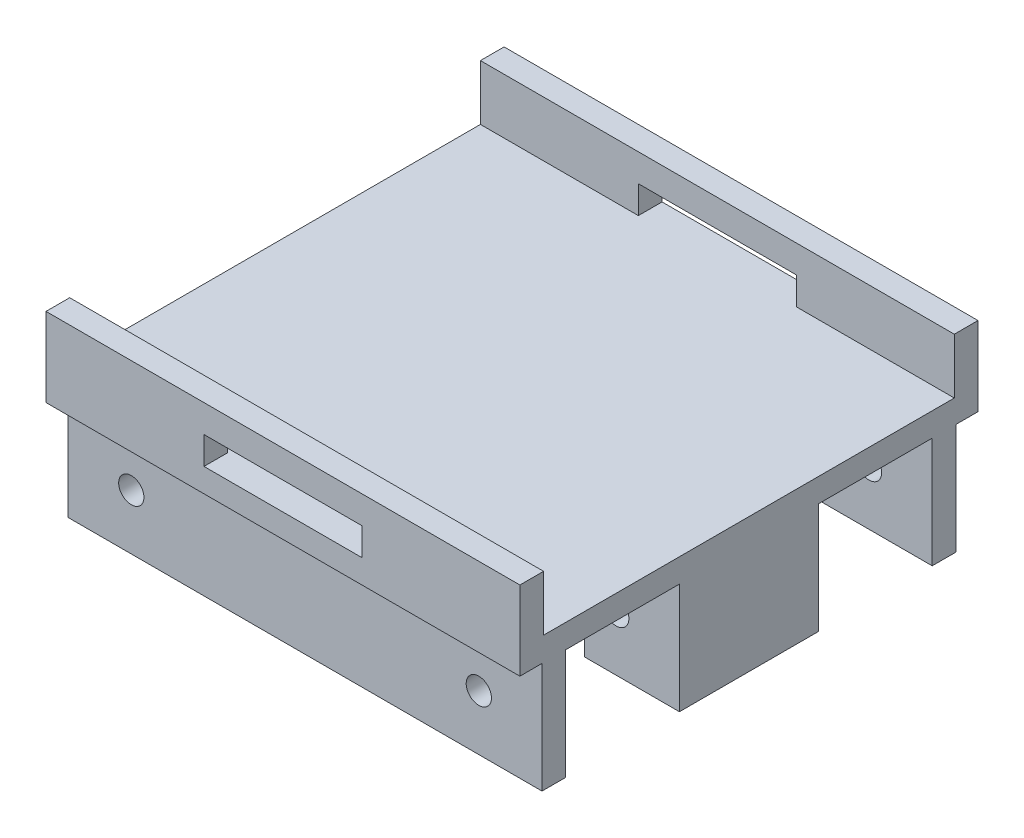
ISO-10303-21;
HEADER;
FILE_DESCRIPTION(('STEP AP214'),'2;1');
FILE_NAME('part.step','',(''),(''),'','','');
FILE_SCHEMA(('AUTOMOTIVE_DESIGN { 1 0 10303 214 1 1 1 1 }'));
ENDSEC;
DATA;
#1=APPLICATION_CONTEXT('core data for automotive mechanical design processes');
#2=APPLICATION_PROTOCOL_DEFINITION('international standard','automotive_design',2000,#1);
#3=PRODUCT_CONTEXT('',#1,'mechanical');
#4=PRODUCT('Part','Part','',(#3));
#5=PRODUCT_RELATED_PRODUCT_CATEGORY('part','',(#4));
#6=PRODUCT_DEFINITION_FORMATION('','',#4);
#7=PRODUCT_DEFINITION_CONTEXT('part definition',#1,'design');
#8=PRODUCT_DEFINITION('design','',#6,#7);
#9=PRODUCT_DEFINITION_SHAPE('','',#8);
#10=(LENGTH_UNIT() NAMED_UNIT(*) SI_UNIT(.MILLI.,.METRE.));
#11=(NAMED_UNIT(*) PLANE_ANGLE_UNIT() SI_UNIT($,.RADIAN.));
#12=(NAMED_UNIT(*) SI_UNIT($,.STERADIAN.) SOLID_ANGLE_UNIT());
#13=UNCERTAINTY_MEASURE_WITH_UNIT(LENGTH_MEASURE(1.E-05),#10,'distance_accuracy_value','');
#14=(GEOMETRIC_REPRESENTATION_CONTEXT(3) GLOBAL_UNCERTAINTY_ASSIGNED_CONTEXT((#13)) GLOBAL_UNIT_ASSIGNED_CONTEXT((#10,
#11,#12)) REPRESENTATION_CONTEXT('',''));
#15=CARTESIAN_POINT('',(0.,0.,0.));
#16=DIRECTION('',(0.,0.,1.));
#17=DIRECTION('',(1.,0.,0.));
#18=AXIS2_PLACEMENT_3D('',#15,#16,#17);
#19=CARTESIAN_POINT('',(60.,0.,15.7431675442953));
#20=DIRECTION('',(0.,0.,1.));
#21=DIRECTION('',(1.,0.,0.));
#22=AXIS2_PLACEMENT_3D('',#19,#20,#21);
#23=PLANE('',#22);
#24=DIRECTION('',(1.,0.,0.));
#25=VECTOR('',#24,1.);
#26=CARTESIAN_POINT('',(60.,7.61845338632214,15.7431675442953));
#27=LINE('',#26,#25);
#28=CARTESIAN_POINT('',(20.,7.61845338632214,15.7431675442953));
#29=VERTEX_POINT('',#28);
#30=CARTESIAN_POINT('',(40.,7.61845338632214,15.7431675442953));
#31=VERTEX_POINT('',#30);
#32=EDGE_CURVE('E639',#29,#31,#27,.T.);
#33=ORIENTED_EDGE('',*,*,#32,.T.);
#34=DIRECTION('',(0.,1.,0.));
#35=VECTOR('',#34,1.);
#36=CARTESIAN_POINT('',(40.,0.,15.7431675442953));
#37=LINE('',#36,#35);
#38=CARTESIAN_POINT('',(40.,4.11845338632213,15.7431675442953));
#39=VERTEX_POINT('',#38);
#40=EDGE_CURVE('E363',#39,#31,#37,.T.);
#41=ORIENTED_EDGE('',*,*,#40,.F.);
#42=DIRECTION('',(-1.,0.,0.));
#43=VECTOR('',#42,1.);
#44=CARTESIAN_POINT('',(60.,4.11845338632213,15.7431675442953));
#45=LINE('',#44,#43);
#46=CARTESIAN_POINT('',(60.,4.11845338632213,15.7431675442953));
#47=VERTEX_POINT('',#46);
#48=EDGE_CURVE('E577',#47,#39,#45,.T.);
#49=ORIENTED_EDGE('',*,*,#48,.F.);
#50=DIRECTION('',(0.,1.,0.));
#51=VECTOR('',#50,1.);
#52=CARTESIAN_POINT('',(60.,0.,15.7431675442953));
#53=LINE('',#52,#51);
#54=CARTESIAN_POINT('',(60.,11.1184533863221,15.7431675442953));
#55=VERTEX_POINT('',#54);
#56=EDGE_CURVE('E508',#47,#55,#53,.T.);
#57=ORIENTED_EDGE('',*,*,#56,.T.);
#58=DIRECTION('',(-1.,0.,0.));
#59=VECTOR('',#58,1.);
#60=CARTESIAN_POINT('',(60.,11.1184533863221,15.7431675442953));
#61=LINE('',#60,#59);
#62=CARTESIAN_POINT('',(0.,11.1184533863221,15.7431675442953));
#63=VERTEX_POINT('',#62);
#64=EDGE_CURVE('E579',#55,#63,#61,.T.);
#65=ORIENTED_EDGE('',*,*,#64,.T.);
#66=DIRECTION('',(0.,1.,0.));
#67=VECTOR('',#66,1.);
#68=CARTESIAN_POINT('',(0.,0.,15.7431675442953));
#69=LINE('',#68,#67);
#70=CARTESIAN_POINT('',(0.,4.11845338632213,15.7431675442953));
#71=VERTEX_POINT('',#70);
#72=EDGE_CURVE('E555',#71,#63,#69,.T.);
#73=ORIENTED_EDGE('',*,*,#72,.F.);
#74=CARTESIAN_POINT('',(20.,4.11845338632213,15.7431675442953));
#75=VERTEX_POINT('',#74);
#76=EDGE_CURVE('E576',#75,#71,#45,.T.);
#77=ORIENTED_EDGE('',*,*,#76,.F.);
#78=DIRECTION('',(0.,1.,0.));
#79=VECTOR('',#78,1.);
#80=CARTESIAN_POINT('',(20.,0.,15.7431675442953));
#81=LINE('',#80,#79);
#82=EDGE_CURVE('E367',#75,#29,#81,.T.);
#83=ORIENTED_EDGE('',*,*,#82,.T.);
#84=EDGE_LOOP('',(#33,#41,#49,#57,#65,#73,#77,#83));
#85=FACE_BOUND('',#84,.T.);
#86=ADVANCED_FACE('F39',(#85),#23,.T.);
#87=CARTESIAN_POINT('',(60.,0.,67.7431675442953));
#88=DIRECTION('',(0.,0.,1.));
#89=DIRECTION('',(1.,0.,0.));
#90=AXIS2_PLACEMENT_3D('',#87,#88,#89);
#91=PLANE('',#90);
#92=DIRECTION('',(0.,1.,0.));
#93=VECTOR('',#92,1.);
#94=CARTESIAN_POINT('',(40.,0.,67.7431675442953));
#95=LINE('',#94,#93);
#96=CARTESIAN_POINT('',(40.,4.11845338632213,67.7431675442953));
#97=VERTEX_POINT('',#96);
#98=CARTESIAN_POINT('',(40.,7.61845338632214,67.7431675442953));
#99=VERTEX_POINT('',#98);
#100=EDGE_CURVE('E353',#97,#99,#95,.T.);
#101=ORIENTED_EDGE('',*,*,#100,.T.);
#102=DIRECTION('',(-1.,0.,0.));
#103=VECTOR('',#102,1.);
#104=CARTESIAN_POINT('',(20.,7.61845338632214,67.7431675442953));
#105=LINE('',#104,#103);
#106=CARTESIAN_POINT('',(20.,7.61845338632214,67.7431675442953));
#107=VERTEX_POINT('',#106);
#108=EDGE_CURVE('E659',#99,#107,#105,.T.);
#109=ORIENTED_EDGE('',*,*,#108,.T.);
#110=DIRECTION('',(0.,1.,0.));
#111=VECTOR('',#110,1.);
#112=CARTESIAN_POINT('',(20.,0.,67.7431675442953));
#113=LINE('',#112,#111);
#114=CARTESIAN_POINT('',(20.,4.11845338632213,67.7431675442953));
#115=VERTEX_POINT('',#114);
#116=EDGE_CURVE('E365',#115,#107,#113,.T.);
#117=ORIENTED_EDGE('',*,*,#116,.F.);
#118=DIRECTION('',(-1.,0.,0.));
#119=VECTOR('',#118,1.);
#120=CARTESIAN_POINT('',(60.,4.11845338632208,67.7431675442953));
#121=LINE('',#120,#119);
#122=CARTESIAN_POINT('',(0.,4.11845338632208,67.7431675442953));
#123=VERTEX_POINT('',#122);
#124=EDGE_CURVE('E328',#115,#123,#121,.T.);
#125=ORIENTED_EDGE('',*,*,#124,.T.);
#126=DIRECTION('',(0.,1.,0.));
#127=VECTOR('',#126,1.);
#128=CARTESIAN_POINT('',(0.,0.,67.7431675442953));
#129=LINE('',#128,#127);
#130=CARTESIAN_POINT('',(0.,11.1184533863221,67.7431675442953));
#131=VERTEX_POINT('',#130);
#132=EDGE_CURVE('E560',#123,#131,#129,.T.);
#133=ORIENTED_EDGE('',*,*,#132,.T.);
#134=DIRECTION('',(-1.,0.,0.));
#135=VECTOR('',#134,1.);
#136=CARTESIAN_POINT('',(60.,11.1184533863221,67.7431675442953));
#137=LINE('',#136,#135);
#138=CARTESIAN_POINT('',(60.,11.1184533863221,67.7431675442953));
#139=VERTEX_POINT('',#138);
#140=EDGE_CURVE('E571',#139,#131,#137,.T.);
#141=ORIENTED_EDGE('',*,*,#140,.F.);
#142=DIRECTION('',(0.,1.,0.));
#143=VECTOR('',#142,1.);
#144=CARTESIAN_POINT('',(60.,0.,67.7431675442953));
#145=LINE('',#144,#143);
#146=CARTESIAN_POINT('',(60.,4.11845338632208,67.7431675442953));
#147=VERTEX_POINT('',#146);
#148=EDGE_CURVE('E513',#147,#139,#145,.T.);
#149=ORIENTED_EDGE('',*,*,#148,.F.);
#150=EDGE_CURVE('E573',#147,#97,#121,.T.);
#151=ORIENTED_EDGE('',*,*,#150,.T.);
#152=EDGE_LOOP('',(#101,#109,#117,#125,#133,#141,#149,#151));
#153=FACE_BOUND('',#152,.T.);
#154=ADVANCED_FACE('F694',(#153),#91,.F.);
#155=CARTESIAN_POINT('',(60.,0.,47.5431675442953));
#156=DIRECTION('',(0.,0.,1.));
#157=DIRECTION('',(1.,0.,0.));
#158=AXIS2_PLACEMENT_3D('',#155,#156,#157);
#159=PLANE('',#158);
#160=CARTESIAN_POINT('',(52.,-5.88154661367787,47.5431675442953));
#161=DIRECTION('',(0.,0.,1.));
#162=DIRECTION('',(1.,0.,0.));
#163=AXIS2_PLACEMENT_3D('',#160,#161,#162);
#164=CIRCLE('',#163,1.6);
#165=CARTESIAN_POINT('',(53.6,-5.88154661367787,47.5431675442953));
#166=VERTEX_POINT('',#165);
#167=EDGE_CURVE('E391',#166,#166,#164,.T.);
#168=ORIENTED_EDGE('',*,*,#167,.T.);
#169=EDGE_LOOP('',(#168));
#170=FACE_BOUND('',#169,.T.);
#171=DIRECTION('',(0.,-1.,0.));
#172=VECTOR('',#171,1.);
#173=CARTESIAN_POINT('',(48.,37.243237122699,47.5431675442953));
#174=LINE('',#173,#172);
#175=CARTESIAN_POINT('',(48.,1.1184533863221,47.5431675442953));
#176=VERTEX_POINT('',#175);
#177=CARTESIAN_POINT('',(48.,-12.8815466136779,47.5431675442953));
#178=VERTEX_POINT('',#177);
#179=EDGE_CURVE('E429',#176,#178,#174,.T.);
#180=ORIENTED_EDGE('',*,*,#179,.F.);
#181=DIRECTION('',(-1.,0.,0.));
#182=VECTOR('',#181,1.);
#183=CARTESIAN_POINT('',(60.,1.11845338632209,47.5431675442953));
#184=LINE('',#183,#182);
#185=CARTESIAN_POINT('',(57.,1.11845338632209,47.5431675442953));
#186=VERTEX_POINT('',#185);
#187=EDGE_CURVE('E614',#186,#176,#184,.T.);
#188=ORIENTED_EDGE('',*,*,#187,.F.);
#189=DIRECTION('',(0.,-1.,0.));
#190=VECTOR('',#189,1.);
#191=CARTESIAN_POINT('',(57.,13.100106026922,47.5431675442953));
#192=LINE('',#191,#190);
#193=CARTESIAN_POINT('',(57.,-12.8815466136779,47.5431675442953));
#194=VERTEX_POINT('',#193);
#195=EDGE_CURVE('E457',#186,#194,#192,.T.);
#196=ORIENTED_EDGE('',*,*,#195,.T.);
#197=DIRECTION('',(-1.,0.,0.));
#198=VECTOR('',#197,1.);
#199=CARTESIAN_POINT('',(60.,-12.8815466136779,47.5431675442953));
#200=LINE('',#199,#198);
#201=EDGE_CURVE('E618',#194,#178,#200,.T.);
#202=ORIENTED_EDGE('',*,*,#201,.T.);
#203=EDGE_LOOP('',(#180,#188,#196,#202));
#204=FACE_BOUND('',#203,.T.);
#205=ADVANCED_FACE('F700',(#170,#204),#159,.F.);
#206=CARTESIAN_POINT('',(60.,0.,35.9431675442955));
#207=DIRECTION('',(0.,0.,-1.));
#208=DIRECTION('',(-1.,0.,0.));
#209=AXIS2_PLACEMENT_3D('',#206,#207,#208);
#210=PLANE('',#209);
#211=CARTESIAN_POINT('',(52.,-5.88154661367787,35.9431675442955));
#212=DIRECTION('',(0.,0.,-1.));
#213=DIRECTION('',(-1.,0.,0.));
#214=AXIS2_PLACEMENT_3D('',#211,#212,#213);
#215=CIRCLE('',#214,1.6);
#216=CARTESIAN_POINT('',(53.6,-5.88154661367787,35.9431675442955));
#217=VERTEX_POINT('',#216);
#218=EDGE_CURVE('E388',#217,#217,#215,.T.);
#219=ORIENTED_EDGE('',*,*,#218,.T.);
#220=EDGE_LOOP('',(#219));
#221=FACE_BOUND('',#220,.T.);
#222=DIRECTION('',(0.,-1.,0.));
#223=VECTOR('',#222,1.);
#224=CARTESIAN_POINT('',(48.,37.243237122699,35.9431675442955));
#225=LINE('',#224,#223);
#226=CARTESIAN_POINT('',(48.,1.1184533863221,35.9431675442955));
#227=VERTEX_POINT('',#226);
#228=CARTESIAN_POINT('',(48.,-12.8815466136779,35.9431675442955));
#229=VERTEX_POINT('',#228);
#230=EDGE_CURVE('E441',#227,#229,#225,.T.);
#231=ORIENTED_EDGE('',*,*,#230,.T.);
#232=DIRECTION('',(-1.,0.,0.));
#233=VECTOR('',#232,1.);
#234=CARTESIAN_POINT('',(60.,-12.8815466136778,35.9431675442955));
#235=LINE('',#234,#233);
#236=CARTESIAN_POINT('',(57.,-12.8815466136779,35.9431675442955));
#237=VERTEX_POINT('',#236);
#238=EDGE_CURVE('E606',#237,#229,#235,.T.);
#239=ORIENTED_EDGE('',*,*,#238,.F.);
#240=DIRECTION('',(0.,-1.,0.));
#241=VECTOR('',#240,1.);
#242=CARTESIAN_POINT('',(57.,13.100106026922,35.9431675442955));
#243=LINE('',#242,#241);
#244=CARTESIAN_POINT('',(57.,1.11845338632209,35.9431675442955));
#245=VERTEX_POINT('',#244);
#246=EDGE_CURVE('E459',#245,#237,#243,.T.);
#247=ORIENTED_EDGE('',*,*,#246,.F.);
#248=DIRECTION('',(-1.,0.,0.));
#249=VECTOR('',#248,1.);
#250=CARTESIAN_POINT('',(60.,1.1184533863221,35.9431675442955));
#251=LINE('',#250,#249);
#252=EDGE_CURVE('E610',#245,#227,#251,.T.);
#253=ORIENTED_EDGE('',*,*,#252,.T.);
#254=EDGE_LOOP('',(#231,#239,#247,#253));
#255=FACE_BOUND('',#254,.T.);
#256=ADVANCED_FACE('F747',(#221,#255),#210,.F.);
#257=CARTESIAN_POINT('',(60.,0.,50.5431675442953));
#258=DIRECTION('',(0.,0.,1.));
#259=DIRECTION('',(1.,0.,0.));
#260=AXIS2_PLACEMENT_3D('',#257,#258,#259);
#261=PLANE('',#260);
#262=CARTESIAN_POINT('',(52.,-5.88154661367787,50.5431675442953));
#263=DIRECTION('',(0.,0.,1.));
#264=DIRECTION('',(1.,0.,0.));
#265=AXIS2_PLACEMENT_3D('',#262,#263,#264);
#266=CIRCLE('',#265,1.6);
#267=CARTESIAN_POINT('',(53.6,-5.88154661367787,50.5431675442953));
#268=VERTEX_POINT('',#267);
#269=EDGE_CURVE('E385',#268,#268,#266,.T.);
#270=ORIENTED_EDGE('',*,*,#269,.F.);
#271=EDGE_LOOP('',(#270));
#272=FACE_BOUND('',#271,.T.);
#273=DIRECTION('',(-1.,0.,0.));
#274=VECTOR('',#273,1.);
#275=CARTESIAN_POINT('',(60.,1.11845338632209,50.5431675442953));
#276=LINE('',#275,#274);
#277=CARTESIAN_POINT('',(60.,1.11845338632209,50.5431675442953));
#278=VERTEX_POINT('',#277);
#279=CARTESIAN_POINT('',(48.,1.11845338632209,50.5431675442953));
#280=VERTEX_POINT('',#279);
#281=EDGE_CURVE('E626',#278,#280,#276,.T.);
#282=ORIENTED_EDGE('',*,*,#281,.T.);
#283=DIRECTION('',(0.,-1.,0.));
#284=VECTOR('',#283,1.);
#285=CARTESIAN_POINT('',(48.,37.243237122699,50.5431675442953));
#286=LINE('',#285,#284);
#287=CARTESIAN_POINT('',(48.,-12.8815466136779,50.5431675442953));
#288=VERTEX_POINT('',#287);
#289=EDGE_CURVE('E422',#280,#288,#286,.T.);
#290=ORIENTED_EDGE('',*,*,#289,.T.);
#291=DIRECTION('',(-1.,0.,0.));
#292=VECTOR('',#291,1.);
#293=CARTESIAN_POINT('',(60.,-12.8815466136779,50.5431675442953));
#294=LINE('',#293,#292);
#295=CARTESIAN_POINT('',(60.,-12.8815466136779,50.5431675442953));
#296=VERTEX_POINT('',#295);
#297=EDGE_CURVE('E622',#296,#288,#294,.T.);
#298=ORIENTED_EDGE('',*,*,#297,.F.);
#299=DIRECTION('',(0.,1.,0.));
#300=VECTOR('',#299,1.);
#301=CARTESIAN_POINT('',(60.,0.,50.5431675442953));
#302=LINE('',#301,#300);
#303=EDGE_CURVE('E488',#296,#278,#302,.T.);
#304=ORIENTED_EDGE('',*,*,#303,.T.);
#305=EDGE_LOOP('',(#282,#290,#298,#304));
#306=FACE_BOUND('',#305,.T.);
#307=ADVANCED_FACE('F755',(#272,#306),#261,.T.);
#308=CARTESIAN_POINT('',(60.,-12.8815466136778,0.));
#309=DIRECTION('',(0.,1.,0.));
#310=DIRECTION('',(0.,0.,1.));
#311=AXIS2_PLACEMENT_3D('',#308,#309,#310);
#312=PLANE('',#311);
#313=DIRECTION('',(0.,0.,-1.));
#314=VECTOR('',#313,1.);
#315=CARTESIAN_POINT('',(48.,-12.8815466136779,0.));
#316=LINE('',#315,#314);
#317=EDGE_CURVE('E418',#288,#178,#316,.T.);
#318=ORIENTED_EDGE('',*,*,#317,.T.);
#319=ORIENTED_EDGE('',*,*,#201,.F.);
#320=DIRECTION('',(0.,0.,-1.));
#321=VECTOR('',#320,1.);
#322=CARTESIAN_POINT('',(57.,-12.8815466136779,0.));
#323=LINE('',#322,#321);
#324=EDGE_CURVE('E453',#194,#237,#323,.T.);
#325=ORIENTED_EDGE('',*,*,#324,.T.);
#326=ORIENTED_EDGE('',*,*,#238,.T.);
#327=DIRECTION('',(0.,0.,-1.));
#328=VECTOR('',#327,1.);
#329=CARTESIAN_POINT('',(48.,-12.8815466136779,0.));
#330=LINE('',#329,#328);
#331=CARTESIAN_POINT('',(48.,-12.8815466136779,32.9431675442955));
#332=VERTEX_POINT('',#331);
#333=EDGE_CURVE('E424',#229,#332,#330,.T.);
#334=ORIENTED_EDGE('',*,*,#333,.T.);
#335=DIRECTION('',(-1.,0.,0.));
#336=VECTOR('',#335,1.);
#337=CARTESIAN_POINT('',(60.,-12.8815466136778,32.9431675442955));
#338=LINE('',#337,#336);
#339=CARTESIAN_POINT('',(60.,-12.8815466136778,32.9431675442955));
#340=VERTEX_POINT('',#339);
#341=EDGE_CURVE('E602',#340,#332,#338,.T.);
#342=ORIENTED_EDGE('',*,*,#341,.F.);
#343=DIRECTION('',(0.,0.,-1.));
#344=VECTOR('',#343,1.);
#345=CARTESIAN_POINT('',(60.,-12.8815466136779,0.));
#346=LINE('',#345,#344);
#347=EDGE_CURVE('E491',#296,#340,#346,.T.);
#348=ORIENTED_EDGE('',*,*,#347,.F.);
#349=ORIENTED_EDGE('',*,*,#297,.T.);
#350=EDGE_LOOP('',(#318,#319,#325,#326,#334,#342,#348,#349));
#351=FACE_BOUND('',#350,.T.);
#352=ADVANCED_FACE('F741',(#351),#312,.F.);
#353=CARTESIAN_POINT('',(60.,0.,32.9431675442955));
#354=DIRECTION('',(0.,0.,-1.));
#355=DIRECTION('',(-1.,0.,0.));
#356=AXIS2_PLACEMENT_3D('',#353,#354,#355);
#357=PLANE('',#356);
#358=CARTESIAN_POINT('',(52.,-5.88154661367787,32.9431675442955));
#359=DIRECTION('',(0.,0.,-1.));
#360=DIRECTION('',(-1.,0.,0.));
#361=AXIS2_PLACEMENT_3D('',#358,#359,#360);
#362=CIRCLE('',#361,1.6);
#363=CARTESIAN_POINT('',(53.6,-5.88154661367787,32.9431675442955));
#364=VERTEX_POINT('',#363);
#365=EDGE_CURVE('E382',#364,#364,#362,.T.);
#366=ORIENTED_EDGE('',*,*,#365,.F.);
#367=EDGE_LOOP('',(#366));
#368=FACE_BOUND('',#367,.T.);
#369=ORIENTED_EDGE('',*,*,#341,.T.);
#370=DIRECTION('',(0.,-1.,0.));
#371=VECTOR('',#370,1.);
#372=CARTESIAN_POINT('',(48.,37.243237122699,32.9431675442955));
#373=LINE('',#372,#371);
#374=CARTESIAN_POINT('',(48.,1.1184533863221,32.9431675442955));
#375=VERTEX_POINT('',#374);
#376=EDGE_CURVE('E446',#375,#332,#373,.T.);
#377=ORIENTED_EDGE('',*,*,#376,.F.);
#378=DIRECTION('',(-1.,0.,0.));
#379=VECTOR('',#378,1.);
#380=CARTESIAN_POINT('',(60.,1.1184533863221,32.9431675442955));
#381=LINE('',#380,#379);
#382=CARTESIAN_POINT('',(60.,1.1184533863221,32.9431675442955));
#383=VERTEX_POINT('',#382);
#384=EDGE_CURVE('E598',#383,#375,#381,.T.);
#385=ORIENTED_EDGE('',*,*,#384,.F.);
#386=DIRECTION('',(0.,-1.,0.));
#387=VECTOR('',#386,1.);
#388=CARTESIAN_POINT('',(60.,0.,32.9431675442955));
#389=LINE('',#388,#387);
#390=EDGE_CURVE('E493',#383,#340,#389,.T.);
#391=ORIENTED_EDGE('',*,*,#390,.T.);
#392=EDGE_LOOP('',(#369,#377,#385,#391));
#393=FACE_BOUND('',#392,.T.);
#394=ADVANCED_FACE('F736',(#368,#393),#357,.T.);
#395=CARTESIAN_POINT('',(8.,-5.88154661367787,47.5431675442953));
#396=DIRECTION('',(0.,0.,1.));
#397=DIRECTION('',(1.,0.,0.));
#398=AXIS2_PLACEMENT_3D('',#395,#396,#397);
#399=CIRCLE('',#398,1.6);
#400=CARTESIAN_POINT('',(9.6,-5.88154661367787,47.5431675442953));
#401=VERTEX_POINT('',#400);
#402=EDGE_CURVE('E410',#401,#401,#399,.T.);
#403=ORIENTED_EDGE('',*,*,#402,.T.);
#404=EDGE_LOOP('',(#403));
#405=FACE_BOUND('',#404,.T.);
#406=CARTESIAN_POINT('',(12.,1.1184533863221,47.5431675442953));
#407=VERTEX_POINT('',#406);
#408=CARTESIAN_POINT('',(3.,1.11845338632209,47.5431675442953));
#409=VERTEX_POINT('',#408);
#410=EDGE_CURVE('E613',#407,#409,#184,.T.);
#411=ORIENTED_EDGE('',*,*,#410,.F.);
#412=DIRECTION('',(0.,-1.,0.));
#413=VECTOR('',#412,1.);
#414=CARTESIAN_POINT('',(12.,37.243237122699,47.5431675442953));
#415=LINE('',#414,#413);
#416=CARTESIAN_POINT('',(12.,-12.8815466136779,47.5431675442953));
#417=VERTEX_POINT('',#416);
#418=EDGE_CURVE('E428',#407,#417,#415,.T.);
#419=ORIENTED_EDGE('',*,*,#418,.T.);
#420=CARTESIAN_POINT('',(3.,-12.8815466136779,47.5431675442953));
#421=VERTEX_POINT('',#420);
#422=EDGE_CURVE('E617',#417,#421,#200,.T.);
#423=ORIENTED_EDGE('',*,*,#422,.T.);
#424=DIRECTION('',(0.,-1.,0.));
#425=VECTOR('',#424,1.);
#426=CARTESIAN_POINT('',(3.,13.100106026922,47.5431675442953));
#427=LINE('',#426,#425);
#428=EDGE_CURVE('E467',#409,#421,#427,.T.);
#429=ORIENTED_EDGE('',*,*,#428,.F.);
#430=EDGE_LOOP('',(#411,#419,#423,#429));
#431=FACE_BOUND('',#430,.T.);
#432=ADVANCED_FACE('F745',(#405,#431),#159,.F.);
#433=CARTESIAN_POINT('',(8.,-5.88154661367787,35.9431675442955));
#434=DIRECTION('',(0.,0.,-1.));
#435=DIRECTION('',(-1.,0.,0.));
#436=AXIS2_PLACEMENT_3D('',#433,#434,#435);
#437=CIRCLE('',#436,1.6);
#438=CARTESIAN_POINT('',(9.6,-5.88154661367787,35.9431675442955));
#439=VERTEX_POINT('',#438);
#440=EDGE_CURVE('E407',#439,#439,#437,.T.);
#441=ORIENTED_EDGE('',*,*,#440,.T.);
#442=EDGE_LOOP('',(#441));
#443=FACE_BOUND('',#442,.T.);
#444=CARTESIAN_POINT('',(12.,-12.8815466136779,35.9431675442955));
#445=VERTEX_POINT('',#444);
#446=CARTESIAN_POINT('',(3.,-12.8815466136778,35.9431675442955));
#447=VERTEX_POINT('',#446);
#448=EDGE_CURVE('E605',#445,#447,#235,.T.);
#449=ORIENTED_EDGE('',*,*,#448,.F.);
#450=DIRECTION('',(0.,-1.,0.));
#451=VECTOR('',#450,1.);
#452=CARTESIAN_POINT('',(12.,37.243237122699,35.9431675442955));
#453=LINE('',#452,#451);
#454=CARTESIAN_POINT('',(12.,1.1184533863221,35.9431675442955));
#455=VERTEX_POINT('',#454);
#456=EDGE_CURVE('E438',#455,#445,#453,.T.);
#457=ORIENTED_EDGE('',*,*,#456,.F.);
#458=CARTESIAN_POINT('',(3.,1.1184533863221,35.9431675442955));
#459=VERTEX_POINT('',#458);
#460=EDGE_CURVE('E609',#455,#459,#251,.T.);
#461=ORIENTED_EDGE('',*,*,#460,.T.);
#462=DIRECTION('',(0.,-1.,0.));
#463=VECTOR('',#462,1.);
#464=CARTESIAN_POINT('',(3.,13.100106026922,35.9431675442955));
#465=LINE('',#464,#463);
#466=EDGE_CURVE('E456',#459,#447,#465,.T.);
#467=ORIENTED_EDGE('',*,*,#466,.T.);
#468=EDGE_LOOP('',(#449,#457,#461,#467));
#469=FACE_BOUND('',#468,.T.);
#470=ADVANCED_FACE('F742',(#443,#469),#210,.F.);
#471=CARTESIAN_POINT('',(60.,1.11845338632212,0.));
#472=DIRECTION('',(0.,1.,0.));
#473=DIRECTION('',(0.,0.,1.));
#474=AXIS2_PLACEMENT_3D('',#471,#472,#473);
#475=PLANE('',#474);
#476=DIRECTION('',(0.,0.,-1.));
#477=VECTOR('',#476,1.);
#478=CARTESIAN_POINT('',(0.,1.11845338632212,0.));
#479=LINE('',#478,#477);
#480=CARTESIAN_POINT('',(0.,1.11845338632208,70.7431675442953));
#481=VERTEX_POINT('',#480);
#482=CARTESIAN_POINT('',(0.,1.11845338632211,67.9431675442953));
#483=VERTEX_POINT('',#482);
#484=EDGE_CURVE('E470',#481,#483,#479,.T.);
#485=ORIENTED_EDGE('',*,*,#484,.T.);
#486=DIRECTION('',(-1.,0.,0.));
#487=VECTOR('',#486,1.);
#488=CARTESIAN_POINT('',(60.,1.11845338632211,67.9431675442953));
#489=LINE('',#488,#487);
#490=CARTESIAN_POINT('',(60.,1.11845338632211,67.9431675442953));
#491=VERTEX_POINT('',#490);
#492=EDGE_CURVE('E636',#491,#483,#489,.T.);
#493=ORIENTED_EDGE('',*,*,#492,.F.);
#494=DIRECTION('',(0.,0.,-1.));
#495=VECTOR('',#494,1.);
#496=CARTESIAN_POINT('',(60.,1.11845338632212,0.));
#497=LINE('',#496,#495);
#498=CARTESIAN_POINT('',(60.,1.11845338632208,70.7431675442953));
#499=VERTEX_POINT('',#498);
#500=EDGE_CURVE('E475',#499,#491,#497,.T.);
#501=ORIENTED_EDGE('',*,*,#500,.F.);
#502=DIRECTION('',(-1.,0.,0.));
#503=VECTOR('',#502,1.);
#504=CARTESIAN_POINT('',(60.,1.11845338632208,70.7431675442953));
#505=LINE('',#504,#503);
#506=EDGE_CURVE('E520',#499,#481,#505,.T.);
#507=ORIENTED_EDGE('',*,*,#506,.T.);
#508=EDGE_LOOP('',(#485,#493,#501,#507));
#509=FACE_BOUND('',#508,.T.);
#510=ADVANCED_FACE('F718',(#509),#475,.F.);
#511=CARTESIAN_POINT('',(60.,0.,67.9431675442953));
#512=DIRECTION('',(0.,0.,-1.));
#513=DIRECTION('',(-1.,0.,0.));
#514=AXIS2_PLACEMENT_3D('',#511,#512,#513);
#515=PLANE('',#514);
#516=CARTESIAN_POINT('',(8.,-5.88154661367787,67.9431675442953));
#517=DIRECTION('',(0.,0.,1.));
#518=DIRECTION('',(1.,0.,0.));
#519=AXIS2_PLACEMENT_3D('',#516,#517,#518);
#520=CIRCLE('',#519,1.6);
#521=CARTESIAN_POINT('',(9.6,-5.88154661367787,67.9431675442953));
#522=VERTEX_POINT('',#521);
#523=EDGE_CURVE('E370',#522,#522,#520,.T.);
#524=ORIENTED_EDGE('',*,*,#523,.F.);
#525=EDGE_LOOP('',(#524));
#526=FACE_BOUND('',#525,.T.);
#527=CARTESIAN_POINT('',(52.,-5.88154661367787,67.9431675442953));
#528=DIRECTION('',(0.,0.,1.));
#529=DIRECTION('',(1.,0.,0.));
#530=AXIS2_PLACEMENT_3D('',#527,#528,#529);
#531=CIRCLE('',#530,1.6);
#532=CARTESIAN_POINT('',(53.6,-5.88154661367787,67.9431675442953));
#533=VERTEX_POINT('',#532);
#534=EDGE_CURVE('E369',#533,#533,#531,.T.);
#535=ORIENTED_EDGE('',*,*,#534,.F.);
#536=EDGE_LOOP('',(#535));
#537=FACE_BOUND('',#536,.T.);
#538=DIRECTION('',(0.,-1.,0.));
#539=VECTOR('',#538,1.);
#540=CARTESIAN_POINT('',(0.,0.,67.9431675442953));
#541=LINE('',#540,#539);
#542=CARTESIAN_POINT('',(0.,-12.8815466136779,67.9431675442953));
#543=VERTEX_POINT('',#542);
#544=EDGE_CURVE('E523',#483,#543,#541,.T.);
#545=ORIENTED_EDGE('',*,*,#544,.T.);
#546=DIRECTION('',(-1.,0.,0.));
#547=VECTOR('',#546,1.);
#548=CARTESIAN_POINT('',(60.,-12.8815466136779,67.9431675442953));
#549=LINE('',#548,#547);
#550=CARTESIAN_POINT('',(60.,-12.8815466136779,67.9431675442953));
#551=VERTEX_POINT('',#550);
#552=EDGE_CURVE('E633',#551,#543,#549,.T.);
#553=ORIENTED_EDGE('',*,*,#552,.F.);
#554=DIRECTION('',(0.,-1.,0.));
#555=VECTOR('',#554,1.);
#556=CARTESIAN_POINT('',(60.,0.,67.9431675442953));
#557=LINE('',#556,#555);
#558=EDGE_CURVE('E478',#491,#551,#557,.T.);
#559=ORIENTED_EDGE('',*,*,#558,.F.);
#560=ORIENTED_EDGE('',*,*,#492,.T.);
#561=EDGE_LOOP('',(#545,#553,#559,#560));
#562=FACE_BOUND('',#561,.T.);
#563=ADVANCED_FACE('F762',(#526,#537,#562),#515,.F.);
#564=CARTESIAN_POINT('',(60.,-12.8815466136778,0.));
#565=DIRECTION('',(0.,1.,0.));
#566=DIRECTION('',(0.,0.,1.));
#567=AXIS2_PLACEMENT_3D('',#564,#565,#566);
#568=PLANE('',#567);
#569=DIRECTION('',(0.,0.,-1.));
#570=VECTOR('',#569,1.);
#571=CARTESIAN_POINT('',(0.,-12.8815466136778,0.));
#572=LINE('',#571,#570);
#573=CARTESIAN_POINT('',(0.,-12.8815466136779,64.9431675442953));
#574=VERTEX_POINT('',#573);
#575=EDGE_CURVE('E527',#543,#574,#572,.T.);
#576=ORIENTED_EDGE('',*,*,#575,.T.);
#577=DIRECTION('',(-1.,0.,0.));
#578=VECTOR('',#577,1.);
#579=CARTESIAN_POINT('',(60.,-12.8815466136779,64.9431675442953));
#580=LINE('',#579,#578);
#581=CARTESIAN_POINT('',(60.,-12.8815466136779,64.9431675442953));
#582=VERTEX_POINT('',#581);
#583=EDGE_CURVE('E631',#582,#574,#580,.T.);
#584=ORIENTED_EDGE('',*,*,#583,.F.);
#585=DIRECTION('',(0.,0.,-1.));
#586=VECTOR('',#585,1.);
#587=CARTESIAN_POINT('',(60.,-12.8815466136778,0.));
#588=LINE('',#587,#586);
#589=EDGE_CURVE('E483',#551,#582,#588,.T.);
#590=ORIENTED_EDGE('',*,*,#589,.F.);
#591=ORIENTED_EDGE('',*,*,#552,.T.);
#592=EDGE_LOOP('',(#576,#584,#590,#591));
#593=FACE_BOUND('',#592,.T.);
#594=ADVANCED_FACE('F758',(#593),#568,.F.);
#595=CARTESIAN_POINT('',(60.,0.,64.9431675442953));
#596=DIRECTION('',(0.,0.,-1.));
#597=DIRECTION('',(-1.,0.,0.));
#598=AXIS2_PLACEMENT_3D('',#595,#596,#597);
#599=PLANE('',#598);
#600=CARTESIAN_POINT('',(8.,-5.88154661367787,64.9431675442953));
#601=DIRECTION('',(0.,0.,-1.));
#602=DIRECTION('',(-1.,0.,0.));
#603=AXIS2_PLACEMENT_3D('',#600,#601,#602);
#604=CIRCLE('',#603,1.6);
#605=CARTESIAN_POINT('',(9.6,-5.88154661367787,64.9431675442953));
#606=VERTEX_POINT('',#605);
#607=EDGE_CURVE('E404',#606,#606,#604,.T.);
#608=ORIENTED_EDGE('',*,*,#607,.F.);
#609=EDGE_LOOP('',(#608));
#610=FACE_BOUND('',#609,.T.);
#611=CARTESIAN_POINT('',(52.,-5.88154661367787,64.9431675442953));
#612=DIRECTION('',(0.,0.,-1.));
#613=DIRECTION('',(-1.,0.,0.));
#614=AXIS2_PLACEMENT_3D('',#611,#612,#613);
#615=CIRCLE('',#614,1.6);
#616=CARTESIAN_POINT('',(53.6,-5.88154661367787,64.9431675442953));
#617=VERTEX_POINT('',#616);
#618=EDGE_CURVE('E379',#617,#617,#615,.T.);
#619=ORIENTED_EDGE('',*,*,#618,.F.);
#620=EDGE_LOOP('',(#619));
#621=FACE_BOUND('',#620,.T.);
#622=DIRECTION('',(0.,-1.,0.));
#623=VECTOR('',#622,1.);
#624=CARTESIAN_POINT('',(0.,0.,64.9431675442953));
#625=LINE('',#624,#623);
#626=CARTESIAN_POINT('',(0.,1.11845338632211,64.9431675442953));
#627=VERTEX_POINT('',#626);
#628=EDGE_CURVE('E530',#627,#574,#625,.T.);
#629=ORIENTED_EDGE('',*,*,#628,.F.);
#630=DIRECTION('',(-1.,0.,0.));
#631=VECTOR('',#630,1.);
#632=CARTESIAN_POINT('',(60.,1.11845338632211,64.9431675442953));
#633=LINE('',#632,#631);
#634=CARTESIAN_POINT('',(60.,1.11845338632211,64.9431675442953));
#635=VERTEX_POINT('',#634);
#636=EDGE_CURVE('E629',#635,#627,#633,.T.);
#637=ORIENTED_EDGE('',*,*,#636,.F.);
#638=DIRECTION('',(0.,-1.,0.));
#639=VECTOR('',#638,1.);
#640=CARTESIAN_POINT('',(60.,0.,64.9431675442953));
#641=LINE('',#640,#639);
#642=EDGE_CURVE('E485',#635,#582,#641,.T.);
#643=ORIENTED_EDGE('',*,*,#642,.T.);
#644=ORIENTED_EDGE('',*,*,#583,.T.);
#645=EDGE_LOOP('',(#629,#637,#643,#644));
#646=FACE_BOUND('',#645,.T.);
#647=ADVANCED_FACE('F753',(#610,#621,#646),#599,.T.);
#648=CARTESIAN_POINT('',(8.,-5.88154661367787,50.5431675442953));
#649=DIRECTION('',(0.,0.,1.));
#650=DIRECTION('',(1.,0.,0.));
#651=AXIS2_PLACEMENT_3D('',#648,#649,#650);
#652=CIRCLE('',#651,1.6);
#653=CARTESIAN_POINT('',(9.6,-5.88154661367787,50.5431675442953));
#654=VERTEX_POINT('',#653);
#655=EDGE_CURVE('E401',#654,#654,#652,.T.);
#656=ORIENTED_EDGE('',*,*,#655,.F.);
#657=EDGE_LOOP('',(#656));
#658=FACE_BOUND('',#657,.T.);
#659=DIRECTION('',(0.,-1.,0.));
#660=VECTOR('',#659,1.);
#661=CARTESIAN_POINT('',(12.,37.243237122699,50.5431675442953));
#662=LINE('',#661,#660);
#663=CARTESIAN_POINT('',(12.,1.11845338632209,50.5431675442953));
#664=VERTEX_POINT('',#663);
#665=CARTESIAN_POINT('',(12.,-12.8815466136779,50.5431675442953));
#666=VERTEX_POINT('',#665);
#667=EDGE_CURVE('E416',#664,#666,#662,.T.);
#668=ORIENTED_EDGE('',*,*,#667,.F.);
#669=CARTESIAN_POINT('',(0.,1.11845338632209,50.5431675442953));
#670=VERTEX_POINT('',#669);
#671=EDGE_CURVE('E625',#664,#670,#276,.T.);
#672=ORIENTED_EDGE('',*,*,#671,.T.);
#673=DIRECTION('',(0.,1.,0.));
#674=VECTOR('',#673,1.);
#675=CARTESIAN_POINT('',(0.,0.,50.5431675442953));
#676=LINE('',#675,#674);
#677=CARTESIAN_POINT('',(0.,-12.8815466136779,50.5431675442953));
#678=VERTEX_POINT('',#677);
#679=EDGE_CURVE('E533',#678,#670,#676,.T.);
#680=ORIENTED_EDGE('',*,*,#679,.F.);
#681=EDGE_CURVE('E621',#666,#678,#294,.T.);
#682=ORIENTED_EDGE('',*,*,#681,.F.);
#683=EDGE_LOOP('',(#668,#672,#680,#682));
#684=FACE_BOUND('',#683,.T.);
#685=ADVANCED_FACE('F739',(#658,#684),#261,.T.);
#686=ORIENTED_EDGE('',*,*,#422,.F.);
#687=DIRECTION('',(0.,0.,-1.));
#688=VECTOR('',#687,1.);
#689=CARTESIAN_POINT('',(12.,-12.8815466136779,0.));
#690=LINE('',#689,#688);
#691=EDGE_CURVE('E414',#666,#417,#690,.T.);
#692=ORIENTED_EDGE('',*,*,#691,.F.);
#693=ORIENTED_EDGE('',*,*,#681,.T.);
#694=DIRECTION('',(0.,0.,-1.));
#695=VECTOR('',#694,1.);
#696=CARTESIAN_POINT('',(0.,-12.8815466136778,0.));
#697=LINE('',#696,#695);
#698=CARTESIAN_POINT('',(0.,-12.8815466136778,32.9431675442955));
#699=VERTEX_POINT('',#698);
#700=EDGE_CURVE('E536',#678,#699,#697,.T.);
#701=ORIENTED_EDGE('',*,*,#700,.T.);
#702=CARTESIAN_POINT('',(12.,-12.8815466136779,32.9431675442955));
#703=VERTEX_POINT('',#702);
#704=EDGE_CURVE('E601',#703,#699,#338,.T.);
#705=ORIENTED_EDGE('',*,*,#704,.F.);
#706=DIRECTION('',(0.,0.,-1.));
#707=VECTOR('',#706,1.);
#708=CARTESIAN_POINT('',(12.,-12.8815466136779,0.));
#709=LINE('',#708,#707);
#710=EDGE_CURVE('E436',#445,#703,#709,.T.);
#711=ORIENTED_EDGE('',*,*,#710,.F.);
#712=ORIENTED_EDGE('',*,*,#448,.T.);
#713=DIRECTION('',(0.,0.,-1.));
#714=VECTOR('',#713,1.);
#715=CARTESIAN_POINT('',(3.00000000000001,-12.8815466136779,0.));
#716=LINE('',#715,#714);
#717=EDGE_CURVE('E463',#421,#447,#716,.T.);
#718=ORIENTED_EDGE('',*,*,#717,.F.);
#719=EDGE_LOOP('',(#686,#692,#693,#701,#705,#711,#712,#718));
#720=FACE_BOUND('',#719,.T.);
#721=ADVANCED_FACE('F734',(#720),#312,.F.);
#722=CARTESIAN_POINT('',(8.,-5.88154661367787,32.9431675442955));
#723=DIRECTION('',(0.,0.,-1.));
#724=DIRECTION('',(-1.,0.,0.));
#725=AXIS2_PLACEMENT_3D('',#722,#723,#724);
#726=CIRCLE('',#725,1.6);
#727=CARTESIAN_POINT('',(9.6,-5.88154661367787,32.9431675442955));
#728=VERTEX_POINT('',#727);
#729=EDGE_CURVE('E398',#728,#728,#726,.T.);
#730=ORIENTED_EDGE('',*,*,#729,.F.);
#731=EDGE_LOOP('',(#730));
#732=FACE_BOUND('',#731,.T.);
#733=DIRECTION('',(0.,-1.,0.));
#734=VECTOR('',#733,1.);
#735=CARTESIAN_POINT('',(12.,37.243237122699,32.9431675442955));
#736=LINE('',#735,#734);
#737=CARTESIAN_POINT('',(12.,1.1184533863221,32.9431675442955));
#738=VERTEX_POINT('',#737);
#739=EDGE_CURVE('E445',#738,#703,#736,.T.);
#740=ORIENTED_EDGE('',*,*,#739,.T.);
#741=ORIENTED_EDGE('',*,*,#704,.T.);
#742=DIRECTION('',(0.,-1.,0.));
#743=VECTOR('',#742,1.);
#744=CARTESIAN_POINT('',(0.,0.,32.9431675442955));
#745=LINE('',#744,#743);
#746=CARTESIAN_POINT('',(0.,1.1184533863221,32.9431675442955));
#747=VERTEX_POINT('',#746);
#748=EDGE_CURVE('E539',#747,#699,#745,.T.);
#749=ORIENTED_EDGE('',*,*,#748,.F.);
#750=EDGE_CURVE('E597',#738,#747,#381,.T.);
#751=ORIENTED_EDGE('',*,*,#750,.F.);
#752=EDGE_LOOP('',(#740,#741,#749,#751));
#753=FACE_BOUND('',#752,.T.);
#754=ADVANCED_FACE('F731',(#732,#753),#357,.T.);
#755=CARTESIAN_POINT('',(0.,1.11845338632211,18.5431675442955));
#756=VERTEX_POINT('',#755);
#757=EDGE_CURVE('E542',#747,#756,#479,.T.);
#758=ORIENTED_EDGE('',*,*,#757,.T.);
#759=DIRECTION('',(-1.,0.,0.));
#760=VECTOR('',#759,1.);
#761=CARTESIAN_POINT('',(60.,1.11845338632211,18.5431675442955));
#762=LINE('',#761,#760);
#763=CARTESIAN_POINT('',(60.,1.11845338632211,18.5431675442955));
#764=VERTEX_POINT('',#763);
#765=EDGE_CURVE('E595',#764,#756,#762,.T.);
#766=ORIENTED_EDGE('',*,*,#765,.F.);
#767=EDGE_CURVE('E496',#383,#764,#497,.T.);
#768=ORIENTED_EDGE('',*,*,#767,.F.);
#769=ORIENTED_EDGE('',*,*,#384,.T.);
#770=DIRECTION('',(0.,0.,-1.));
#771=VECTOR('',#770,1.);
#772=CARTESIAN_POINT('',(48.,1.11845338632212,0.));
#773=LINE('',#772,#771);
#774=EDGE_CURVE('E413',#227,#375,#773,.T.);
#775=ORIENTED_EDGE('',*,*,#774,.F.);
#776=ORIENTED_EDGE('',*,*,#252,.F.);
#777=DIRECTION('',(0.,0.,-1.));
#778=VECTOR('',#777,1.);
#779=CARTESIAN_POINT('',(57.,1.11845338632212,0.));
#780=LINE('',#779,#778);
#781=EDGE_CURVE('E421',#186,#245,#780,.T.);
#782=ORIENTED_EDGE('',*,*,#781,.F.);
#783=ORIENTED_EDGE('',*,*,#187,.T.);
#784=DIRECTION('',(0.,0.,-1.));
#785=VECTOR('',#784,1.);
#786=CARTESIAN_POINT('',(48.,1.11845338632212,0.));
#787=LINE('',#786,#785);
#788=EDGE_CURVE('E417',#280,#176,#787,.T.);
#789=ORIENTED_EDGE('',*,*,#788,.F.);
#790=ORIENTED_EDGE('',*,*,#281,.F.);
#791=EDGE_CURVE('E481',#635,#278,#497,.T.);
#792=ORIENTED_EDGE('',*,*,#791,.F.);
#793=ORIENTED_EDGE('',*,*,#636,.T.);
#794=EDGE_CURVE('E525',#627,#670,#479,.T.);
#795=ORIENTED_EDGE('',*,*,#794,.T.);
#796=ORIENTED_EDGE('',*,*,#671,.F.);
#797=DIRECTION('',(0.,0.,-1.));
#798=VECTOR('',#797,1.);
#799=CARTESIAN_POINT('',(12.,1.11845338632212,0.));
#800=LINE('',#799,#798);
#801=EDGE_CURVE('E425',#664,#407,#800,.T.);
#802=ORIENTED_EDGE('',*,*,#801,.T.);
#803=ORIENTED_EDGE('',*,*,#410,.T.);
#804=DIRECTION('',(0.,0.,-1.));
#805=VECTOR('',#804,1.);
#806=CARTESIAN_POINT('',(3.00000000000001,1.11845338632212,0.));
#807=LINE('',#806,#805);
#808=EDGE_CURVE('E466',#409,#459,#807,.T.);
#809=ORIENTED_EDGE('',*,*,#808,.T.);
#810=ORIENTED_EDGE('',*,*,#460,.F.);
#811=DIRECTION('',(0.,0.,-1.));
#812=VECTOR('',#811,1.);
#813=CARTESIAN_POINT('',(12.,1.11845338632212,0.));
#814=LINE('',#813,#812);
#815=EDGE_CURVE('E443',#455,#738,#814,.T.);
#816=ORIENTED_EDGE('',*,*,#815,.T.);
#817=ORIENTED_EDGE('',*,*,#750,.T.);
#818=EDGE_LOOP('',(#758,#766,#768,#769,#775,#776,#782,#783,#789,#790,#792,#793,#795,#796,#802,
#803,#809,#810,#816,#817));
#819=FACE_BOUND('',#818,.T.);
#820=ADVANCED_FACE('F719',(#819),#475,.F.);
#821=CARTESIAN_POINT('',(60.,0.,18.5431675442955));
#822=DIRECTION('',(0.,0.,1.));
#823=DIRECTION('',(0.,-1.,0.));
#824=AXIS2_PLACEMENT_3D('',#821,#822,#823);
#825=PLANE('',#824);
#826=CARTESIAN_POINT('',(8.,-5.88154661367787,18.5431675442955));
#827=DIRECTION('',(0.,0.,1.));
#828=DIRECTION('',(0.,-1.,0.));
#829=AXIS2_PLACEMENT_3D('',#826,#827,#828);
#830=CIRCLE('',#829,1.6);
#831=CARTESIAN_POINT('',(9.6,-5.88154661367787,18.5431675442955));
#832=VERTEX_POINT('',#831);
#833=EDGE_CURVE('E395',#832,#832,#830,.T.);
#834=ORIENTED_EDGE('',*,*,#833,.F.);
#835=EDGE_LOOP('',(#834));
#836=FACE_BOUND('',#835,.T.);
#837=CARTESIAN_POINT('',(52.,-5.88154661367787,18.5431675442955));
#838=DIRECTION('',(0.,0.,1.));
#839=DIRECTION('',(0.,-1.,0.));
#840=AXIS2_PLACEMENT_3D('',#837,#838,#839);
#841=CIRCLE('',#840,1.6);
#842=CARTESIAN_POINT('',(53.6,-5.88154661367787,18.5431675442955));
#843=VERTEX_POINT('',#842);
#844=EDGE_CURVE('E376',#843,#843,#841,.T.);
#845=ORIENTED_EDGE('',*,*,#844,.F.);
#846=EDGE_LOOP('',(#845));
#847=FACE_BOUND('',#846,.T.);
#848=DIRECTION('',(0.,1.,0.));
#849=VECTOR('',#848,1.);
#850=CARTESIAN_POINT('',(0.,0.,18.5431675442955));
#851=LINE('',#850,#849);
#852=CARTESIAN_POINT('',(0.,-12.8815466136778,18.5431675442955));
#853=VERTEX_POINT('',#852);
#854=EDGE_CURVE('E543',#853,#756,#851,.T.);
#855=ORIENTED_EDGE('',*,*,#854,.F.);
#856=DIRECTION('',(-1.,0.,0.));
#857=VECTOR('',#856,1.);
#858=CARTESIAN_POINT('',(60.,-12.8815466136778,18.5431675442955));
#859=LINE('',#858,#857);
#860=CARTESIAN_POINT('',(60.,-12.8815466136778,18.5431675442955));
#861=VERTEX_POINT('',#860);
#862=EDGE_CURVE('E593',#861,#853,#859,.T.);
#863=ORIENTED_EDGE('',*,*,#862,.F.);
#864=DIRECTION('',(0.,1.,0.));
#865=VECTOR('',#864,1.);
#866=CARTESIAN_POINT('',(60.,0.,18.5431675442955));
#867=LINE('',#866,#865);
#868=EDGE_CURVE('E497',#861,#764,#867,.T.);
#869=ORIENTED_EDGE('',*,*,#868,.T.);
#870=ORIENTED_EDGE('',*,*,#765,.T.);
#871=EDGE_LOOP('',(#855,#863,#869,#870));
#872=FACE_BOUND('',#871,.T.);
#873=ADVANCED_FACE('F726',(#836,#847,#872),#825,.T.);
#874=CARTESIAN_POINT('',(60.,-12.8815466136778,0.));
#875=DIRECTION('',(0.,1.,0.));
#876=DIRECTION('',(0.,0.,1.));
#877=AXIS2_PLACEMENT_3D('',#874,#875,#876);
#878=PLANE('',#877);
#879=DIRECTION('',(0.,0.,-1.));
#880=VECTOR('',#879,1.);
#881=CARTESIAN_POINT('',(0.,-12.8815466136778,0.));
#882=LINE('',#881,#880);
#883=CARTESIAN_POINT('',(0.,-12.8815466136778,15.5431675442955));
#884=VERTEX_POINT('',#883);
#885=EDGE_CURVE('E546',#853,#884,#882,.T.);
#886=ORIENTED_EDGE('',*,*,#885,.T.);
#887=DIRECTION('',(-1.,0.,0.));
#888=VECTOR('',#887,1.);
#889=CARTESIAN_POINT('',(60.,-12.8815466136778,15.5431675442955));
#890=LINE('',#889,#888);
#891=CARTESIAN_POINT('',(60.,-12.8815466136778,15.5431675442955));
#892=VERTEX_POINT('',#891);
#893=EDGE_CURVE('E590',#892,#884,#890,.T.);
#894=ORIENTED_EDGE('',*,*,#893,.F.);
#895=DIRECTION('',(0.,0.,-1.));
#896=VECTOR('',#895,1.);
#897=CARTESIAN_POINT('',(60.,-12.8815466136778,0.));
#898=LINE('',#897,#896);
#899=EDGE_CURVE('E500',#861,#892,#898,.T.);
#900=ORIENTED_EDGE('',*,*,#899,.F.);
#901=ORIENTED_EDGE('',*,*,#862,.T.);
#902=EDGE_LOOP('',(#886,#894,#900,#901));
#903=FACE_BOUND('',#902,.T.);
#904=ADVANCED_FACE('F722',(#903),#878,.F.);
#905=CARTESIAN_POINT('',(60.,0.,15.5431675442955));
#906=DIRECTION('',(0.,0.,1.));
#907=DIRECTION('',(0.,-1.,0.));
#908=AXIS2_PLACEMENT_3D('',#905,#906,#907);
#909=PLANE('',#908);
#910=CARTESIAN_POINT('',(8.,-5.88154661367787,15.5431675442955));
#911=DIRECTION('',(0.,0.,1.));
#912=DIRECTION('',(0.,-1.,0.));
#913=AXIS2_PLACEMENT_3D('',#910,#911,#912);
#914=CIRCLE('',#913,1.6);
#915=CARTESIAN_POINT('',(9.6,-5.88154661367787,15.5431675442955));
#916=VERTEX_POINT('',#915);
#917=EDGE_CURVE('E394',#916,#916,#914,.T.);
#918=ORIENTED_EDGE('',*,*,#917,.T.);
#919=EDGE_LOOP('',(#918));
#920=FACE_BOUND('',#919,.T.);
#921=CARTESIAN_POINT('',(52.,-5.88154661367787,15.5431675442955));
#922=DIRECTION('',(0.,0.,1.));
#923=DIRECTION('',(0.,-1.,0.));
#924=AXIS2_PLACEMENT_3D('',#921,#922,#923);
#925=CIRCLE('',#924,1.6);
#926=CARTESIAN_POINT('',(53.6,-5.88154661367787,15.5431675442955));
#927=VERTEX_POINT('',#926);
#928=EDGE_CURVE('E373',#927,#927,#925,.T.);
#929=ORIENTED_EDGE('',*,*,#928,.T.);
#930=EDGE_LOOP('',(#929));
#931=FACE_BOUND('',#930,.T.);
#932=DIRECTION('',(0.,1.,0.));
#933=VECTOR('',#932,1.);
#934=CARTESIAN_POINT('',(0.,0.,15.5431675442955));
#935=LINE('',#934,#933);
#936=CARTESIAN_POINT('',(0.,1.11845338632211,15.5431675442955));
#937=VERTEX_POINT('',#936);
#938=EDGE_CURVE('E548',#884,#937,#935,.T.);
#939=ORIENTED_EDGE('',*,*,#938,.T.);
#940=DIRECTION('',(-1.,0.,0.));
#941=VECTOR('',#940,1.);
#942=CARTESIAN_POINT('',(60.,1.11845338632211,15.5431675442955));
#943=LINE('',#942,#941);
#944=CARTESIAN_POINT('',(60.,1.11845338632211,15.5431675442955));
#945=VERTEX_POINT('',#944);
#946=EDGE_CURVE('E587',#945,#937,#943,.T.);
#947=ORIENTED_EDGE('',*,*,#946,.F.);
#948=DIRECTION('',(0.,1.,0.));
#949=VECTOR('',#948,1.);
#950=CARTESIAN_POINT('',(60.,0.,15.5431675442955));
#951=LINE('',#950,#949);
#952=EDGE_CURVE('E502',#892,#945,#951,.T.);
#953=ORIENTED_EDGE('',*,*,#952,.F.);
#954=ORIENTED_EDGE('',*,*,#893,.T.);
#955=EDGE_LOOP('',(#939,#947,#953,#954));
#956=FACE_BOUND('',#955,.T.);
#957=ADVANCED_FACE('F716',(#920,#931,#956),#909,.F.);
#958=CARTESIAN_POINT('',(0.,1.11845338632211,12.7431675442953));
#959=VERTEX_POINT('',#958);
#960=EDGE_CURVE('E524',#937,#959,#479,.T.);
#961=ORIENTED_EDGE('',*,*,#960,.T.);
#962=DIRECTION('',(-1.,0.,0.));
#963=VECTOR('',#962,1.);
#964=CARTESIAN_POINT('',(60.,1.11845338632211,12.7431675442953));
#965=LINE('',#964,#963);
#966=CARTESIAN_POINT('',(60.,1.11845338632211,12.7431675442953));
#967=VERTEX_POINT('',#966);
#968=EDGE_CURVE('E584',#967,#959,#965,.T.);
#969=ORIENTED_EDGE('',*,*,#968,.F.);
#970=EDGE_CURVE('E480',#945,#967,#497,.T.);
#971=ORIENTED_EDGE('',*,*,#970,.F.);
#972=ORIENTED_EDGE('',*,*,#946,.T.);
#973=EDGE_LOOP('',(#961,#969,#971,#972));
#974=FACE_BOUND('',#973,.T.);
#975=ADVANCED_FACE('F712',(#974),#475,.F.);
#976=CARTESIAN_POINT('',(60.,0.,12.7431675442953));
#977=DIRECTION('',(0.,0.,1.));
#978=DIRECTION('',(0.,-1.,0.));
#979=AXIS2_PLACEMENT_3D('',#976,#977,#978);
#980=PLANE('',#979);
#981=DIRECTION('',(0.,1.,0.));
#982=VECTOR('',#981,1.);
#983=CARTESIAN_POINT('',(40.,0.,12.7431675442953));
#984=LINE('',#983,#982);
#985=CARTESIAN_POINT('',(40.,4.11845338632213,12.7431675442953));
#986=VERTEX_POINT('',#985);
#987=CARTESIAN_POINT('',(40.,7.61845338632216,12.7431675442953));
#988=VERTEX_POINT('',#987);
#989=EDGE_CURVE('E347',#986,#988,#984,.T.);
#990=ORIENTED_EDGE('',*,*,#989,.T.);
#991=DIRECTION('',(-1.,0.,0.));
#992=VECTOR('',#991,1.);
#993=CARTESIAN_POINT('',(20.,7.61845338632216,12.7431675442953));
#994=LINE('',#993,#992);
#995=CARTESIAN_POINT('',(20.,7.61845338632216,12.7431675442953));
#996=VERTEX_POINT('',#995);
#997=EDGE_CURVE('E651',#988,#996,#994,.T.);
#998=ORIENTED_EDGE('',*,*,#997,.T.);
#999=DIRECTION('',(0.,1.,0.));
#1000=VECTOR('',#999,1.);
#1001=CARTESIAN_POINT('',(20.,0.,12.7431675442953));
#1002=LINE('',#1001,#1000);
#1003=CARTESIAN_POINT('',(20.,4.11845338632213,12.7431675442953));
#1004=VERTEX_POINT('',#1003);
#1005=EDGE_CURVE('E349',#1004,#996,#1002,.T.);
#1006=ORIENTED_EDGE('',*,*,#1005,.F.);
#1007=DIRECTION('',(1.,0.,0.));
#1008=VECTOR('',#1007,1.);
#1009=CARTESIAN_POINT('',(0.,4.11845338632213,12.7431675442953));
#1010=LINE('',#1009,#1008);
#1011=EDGE_CURVE('E338',#1004,#986,#1010,.T.);
#1012=ORIENTED_EDGE('',*,*,#1011,.T.);
#1013=EDGE_LOOP('',(#990,#998,#1006,#1012));
#1014=FACE_BOUND('',#1013,.T.);
#1015=DIRECTION('',(0.,1.,0.));
#1016=VECTOR('',#1015,1.);
#1017=CARTESIAN_POINT('',(0.,0.,12.7431675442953));
#1018=LINE('',#1017,#1016);
#1019=CARTESIAN_POINT('',(0.,11.1184533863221,12.7431675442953));
#1020=VERTEX_POINT('',#1019);
#1021=EDGE_CURVE('E550',#959,#1020,#1018,.T.);
#1022=ORIENTED_EDGE('',*,*,#1021,.T.);
#1023=DIRECTION('',(-1.,0.,0.));
#1024=VECTOR('',#1023,1.);
#1025=CARTESIAN_POINT('',(60.,11.1184533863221,12.7431675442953));
#1026=LINE('',#1025,#1024);
#1027=CARTESIAN_POINT('',(60.,11.1184533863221,12.7431675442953));
#1028=VERTEX_POINT('',#1027);
#1029=EDGE_CURVE('E581',#1028,#1020,#1026,.T.);
#1030=ORIENTED_EDGE('',*,*,#1029,.F.);
#1031=DIRECTION('',(0.,1.,0.));
#1032=VECTOR('',#1031,1.);
#1033=CARTESIAN_POINT('',(60.,0.,12.7431675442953));
#1034=LINE('',#1033,#1032);
#1035=EDGE_CURVE('E504',#967,#1028,#1034,.T.);
#1036=ORIENTED_EDGE('',*,*,#1035,.F.);
#1037=ORIENTED_EDGE('',*,*,#968,.T.);
#1038=EDGE_LOOP('',(#1022,#1030,#1036,#1037));
#1039=FACE_BOUND('',#1038,.T.);
#1040=ADVANCED_FACE('F708',(#1014,#1039),#980,.F.);
#1041=CARTESIAN_POINT('',(60.,11.1184533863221,0.));
#1042=DIRECTION('',(0.,-1.,0.));
#1043=DIRECTION('',(0.,0.,-1.));
#1044=AXIS2_PLACEMENT_3D('',#1041,#1042,#1043);
#1045=PLANE('',#1044);
#1046=DIRECTION('',(0.,0.,1.));
#1047=VECTOR('',#1046,1.);
#1048=CARTESIAN_POINT('',(0.,11.1184533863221,0.));
#1049=LINE('',#1048,#1047);
#1050=EDGE_CURVE('E552',#1020,#63,#1049,.T.);
#1051=ORIENTED_EDGE('',*,*,#1050,.T.);
#1052=ORIENTED_EDGE('',*,*,#64,.F.);
#1053=DIRECTION('',(0.,0.,1.));
#1054=VECTOR('',#1053,1.);
#1055=CARTESIAN_POINT('',(60.,11.1184533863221,0.));
#1056=LINE('',#1055,#1054);
#1057=EDGE_CURVE('E506',#1028,#55,#1056,.T.);
#1058=ORIENTED_EDGE('',*,*,#1057,.F.);
#1059=ORIENTED_EDGE('',*,*,#1029,.T.);
#1060=EDGE_LOOP('',(#1051,#1052,#1058,#1059));
#1061=FACE_BOUND('',#1060,.T.);
#1062=ADVANCED_FACE('F705',(#1061),#1045,.F.);
#1063=CARTESIAN_POINT('',(60.,4.11845338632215,0.));
#1064=DIRECTION('',(0.,-1.,0.));
#1065=DIRECTION('',(0.,0.,-1.));
#1066=AXIS2_PLACEMENT_3D('',#1063,#1064,#1065);
#1067=PLANE('',#1066);
#1068=ORIENTED_EDGE('',*,*,#48,.T.);
#1069=DIRECTION('',(0.,0.,1.));
#1070=VECTOR('',#1069,1.);
#1071=CARTESIAN_POINT('',(40.,4.11845338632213,12.7431675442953));
#1072=LINE('',#1071,#1070);
#1073=EDGE_CURVE('E360',#986,#39,#1072,.T.);
#1074=ORIENTED_EDGE('',*,*,#1073,.F.);
#1075=ORIENTED_EDGE('',*,*,#1011,.F.);
#1076=DIRECTION('',(0.,0.,1.));
#1077=VECTOR('',#1076,1.);
#1078=CARTESIAN_POINT('',(20.,4.11845338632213,12.7431675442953));
#1079=LINE('',#1078,#1077);
#1080=EDGE_CURVE('E331',#1004,#75,#1079,.T.);
#1081=ORIENTED_EDGE('',*,*,#1080,.T.);
#1082=ORIENTED_EDGE('',*,*,#76,.T.);
#1083=DIRECTION('',(0.,0.,1.));
#1084=VECTOR('',#1083,1.);
#1085=CARTESIAN_POINT('',(0.,4.11845338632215,0.));
#1086=LINE('',#1085,#1084);
#1087=EDGE_CURVE('E558',#71,#123,#1086,.T.);
#1088=ORIENTED_EDGE('',*,*,#1087,.T.);
#1089=ORIENTED_EDGE('',*,*,#124,.F.);
#1090=CARTESIAN_POINT('',(20.,4.11845338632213,70.7431675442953));
#1091=VERTEX_POINT('',#1090);
#1092=EDGE_CURVE('E322',#115,#1091,#1079,.T.);
#1093=ORIENTED_EDGE('',*,*,#1092,.T.);
#1094=DIRECTION('',(1.,0.,0.));
#1095=VECTOR('',#1094,1.);
#1096=CARTESIAN_POINT('',(0.,4.11845338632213,70.7431675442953));
#1097=LINE('',#1096,#1095);
#1098=CARTESIAN_POINT('',(40.,4.11845338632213,70.7431675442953));
#1099=VERTEX_POINT('',#1098);
#1100=EDGE_CURVE('E326',#1091,#1099,#1097,.T.);
#1101=ORIENTED_EDGE('',*,*,#1100,.T.);
#1102=EDGE_CURVE('E350',#97,#1099,#1072,.T.);
#1103=ORIENTED_EDGE('',*,*,#1102,.F.);
#1104=ORIENTED_EDGE('',*,*,#150,.F.);
#1105=DIRECTION('',(0.,0.,1.));
#1106=VECTOR('',#1105,1.);
#1107=CARTESIAN_POINT('',(60.,4.11845338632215,0.));
#1108=LINE('',#1107,#1106);
#1109=EDGE_CURVE('E511',#47,#147,#1108,.T.);
#1110=ORIENTED_EDGE('',*,*,#1109,.F.);
#1111=EDGE_LOOP('',(#1068,#1074,#1075,#1081,#1082,#1088,#1089,#1093,#1101,#1103,#1104,#1110));
#1112=FACE_BOUND('',#1111,.T.);
#1113=ADVANCED_FACE('F324',(#1112),#1067,.F.);
#1114=CARTESIAN_POINT('',(60.,11.1184533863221,0.));
#1115=DIRECTION('',(0.,1.,0.));
#1116=DIRECTION('',(0.,0.,1.));
#1117=AXIS2_PLACEMENT_3D('',#1114,#1115,#1116);
#1118=PLANE('',#1117);
#1119=DIRECTION('',(0.,0.,-1.));
#1120=VECTOR('',#1119,1.);
#1121=CARTESIAN_POINT('',(0.,11.1184533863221,0.));
#1122=LINE('',#1121,#1120);
#1123=CARTESIAN_POINT('',(0.,11.1184533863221,70.7431675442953));
#1124=VERTEX_POINT('',#1123);
#1125=EDGE_CURVE('E563',#1124,#131,#1122,.T.);
#1126=ORIENTED_EDGE('',*,*,#1125,.F.);
#1127=DIRECTION('',(-1.,0.,0.));
#1128=VECTOR('',#1127,1.);
#1129=CARTESIAN_POINT('',(60.,11.1184533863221,70.7431675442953));
#1130=LINE('',#1129,#1128);
#1131=CARTESIAN_POINT('',(60.,11.1184533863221,70.7431675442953));
#1132=VERTEX_POINT('',#1131);
#1133=EDGE_CURVE('E569',#1132,#1124,#1130,.T.);
#1134=ORIENTED_EDGE('',*,*,#1133,.F.);
#1135=DIRECTION('',(0.,0.,-1.));
#1136=VECTOR('',#1135,1.);
#1137=CARTESIAN_POINT('',(60.,11.1184533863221,0.));
#1138=LINE('',#1137,#1136);
#1139=EDGE_CURVE('E515',#1132,#139,#1138,.T.);
#1140=ORIENTED_EDGE('',*,*,#1139,.T.);
#1141=ORIENTED_EDGE('',*,*,#140,.T.);
#1142=EDGE_LOOP('',(#1126,#1134,#1140,#1141));
#1143=FACE_BOUND('',#1142,.T.);
#1144=ADVANCED_FACE('F920',(#1143),#1118,.T.);
#1145=CARTESIAN_POINT('',(60.,0.,70.7431675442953));
#1146=DIRECTION('',(0.,0.,-1.));
#1147=DIRECTION('',(-1.,0.,0.));
#1148=AXIS2_PLACEMENT_3D('',#1145,#1146,#1147);
#1149=PLANE('',#1148);
#1150=DIRECTION('',(1.,0.,0.));
#1151=VECTOR('',#1150,1.);
#1152=CARTESIAN_POINT('',(40.,7.61845338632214,70.7431675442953));
#1153=LINE('',#1152,#1151);
#1154=CARTESIAN_POINT('',(20.,7.61845338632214,70.7431675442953));
#1155=VERTEX_POINT('',#1154);
#1156=CARTESIAN_POINT('',(40.,7.61845338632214,70.7431675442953));
#1157=VERTEX_POINT('',#1156);
#1158=EDGE_CURVE('E662',#1155,#1157,#1153,.T.);
#1159=ORIENTED_EDGE('',*,*,#1158,.T.);
#1160=DIRECTION('',(0.,1.,0.));
#1161=VECTOR('',#1160,1.);
#1162=CARTESIAN_POINT('',(40.,0.,70.7431675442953));
#1163=LINE('',#1162,#1161);
#1164=EDGE_CURVE('E55',#1099,#1157,#1163,.T.);
#1165=ORIENTED_EDGE('',*,*,#1164,.F.);
#1166=ORIENTED_EDGE('',*,*,#1100,.F.);
#1167=DIRECTION('',(0.,1.,0.));
#1168=VECTOR('',#1167,1.);
#1169=CARTESIAN_POINT('',(20.,0.,70.7431675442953));
#1170=LINE('',#1169,#1168);
#1171=EDGE_CURVE('E63',#1091,#1155,#1170,.T.);
#1172=ORIENTED_EDGE('',*,*,#1171,.T.);
#1173=EDGE_LOOP('',(#1159,#1165,#1166,#1172));
#1174=FACE_BOUND('',#1173,.T.);
#1175=DIRECTION('',(0.,-1.,0.));
#1176=VECTOR('',#1175,1.);
#1177=CARTESIAN_POINT('',(0.,0.,70.7431675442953));
#1178=LINE('',#1177,#1176);
#1179=EDGE_CURVE('E479',#1124,#481,#1178,.T.);
#1180=ORIENTED_EDGE('',*,*,#1179,.T.);
#1181=ORIENTED_EDGE('',*,*,#506,.F.);
#1182=DIRECTION('',(0.,-1.,0.));
#1183=VECTOR('',#1182,1.);
#1184=CARTESIAN_POINT('',(60.,0.,70.7431675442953));
#1185=LINE('',#1184,#1183);
#1186=EDGE_CURVE('E518',#1132,#499,#1185,.T.);
#1187=ORIENTED_EDGE('',*,*,#1186,.F.);
#1188=ORIENTED_EDGE('',*,*,#1133,.T.);
#1189=EDGE_LOOP('',(#1180,#1181,#1187,#1188));
#1190=FACE_BOUND('',#1189,.T.);
#1191=ADVANCED_FACE('F340',(#1174,#1190),#1149,.F.);
#1192=CARTESIAN_POINT('',(60.,0.,0.));
#1193=DIRECTION('',(1.,0.,0.));
#1194=DIRECTION('',(0.,0.,-1.));
#1195=AXIS2_PLACEMENT_3D('',#1192,#1193,#1194);
#1196=PLANE('',#1195);
#1197=ORIENTED_EDGE('',*,*,#347,.T.);
#1198=ORIENTED_EDGE('',*,*,#390,.F.);
#1199=ORIENTED_EDGE('',*,*,#767,.T.);
#1200=ORIENTED_EDGE('',*,*,#868,.F.);
#1201=ORIENTED_EDGE('',*,*,#899,.T.);
#1202=ORIENTED_EDGE('',*,*,#952,.T.);
#1203=ORIENTED_EDGE('',*,*,#970,.T.);
#1204=ORIENTED_EDGE('',*,*,#1035,.T.);
#1205=ORIENTED_EDGE('',*,*,#1057,.T.);
#1206=ORIENTED_EDGE('',*,*,#56,.F.);
#1207=ORIENTED_EDGE('',*,*,#1109,.T.);
#1208=ORIENTED_EDGE('',*,*,#148,.T.);
#1209=ORIENTED_EDGE('',*,*,#1139,.F.);
#1210=ORIENTED_EDGE('',*,*,#1186,.T.);
#1211=ORIENTED_EDGE('',*,*,#500,.T.);
#1212=ORIENTED_EDGE('',*,*,#558,.T.);
#1213=ORIENTED_EDGE('',*,*,#589,.T.);
#1214=ORIENTED_EDGE('',*,*,#642,.F.);
#1215=ORIENTED_EDGE('',*,*,#791,.T.);
#1216=ORIENTED_EDGE('',*,*,#303,.F.);
#1217=EDGE_LOOP('',(#1197,#1198,#1199,#1200,#1201,#1202,#1203,#1204,#1205,#1206,#1207,#1208,
#1209,#1210,#1211,#1212,#1213,#1214,#1215,#1216));
#1218=FACE_BOUND('',#1217,.T.);
#1219=ADVANCED_FACE('F824',(#1218),#1196,.T.);
#1220=CARTESIAN_POINT('',(0.,0.,0.));
#1221=DIRECTION('',(1.,0.,0.));
#1222=DIRECTION('',(0.,0.,-1.));
#1223=AXIS2_PLACEMENT_3D('',#1220,#1221,#1222);
#1224=PLANE('',#1223);
#1225=ORIENTED_EDGE('',*,*,#700,.F.);
#1226=ORIENTED_EDGE('',*,*,#679,.T.);
#1227=ORIENTED_EDGE('',*,*,#794,.F.);
#1228=ORIENTED_EDGE('',*,*,#628,.T.);
#1229=ORIENTED_EDGE('',*,*,#575,.F.);
#1230=ORIENTED_EDGE('',*,*,#544,.F.);
#1231=ORIENTED_EDGE('',*,*,#484,.F.);
#1232=ORIENTED_EDGE('',*,*,#1179,.F.);
#1233=ORIENTED_EDGE('',*,*,#1125,.T.);
#1234=ORIENTED_EDGE('',*,*,#132,.F.);
#1235=ORIENTED_EDGE('',*,*,#1087,.F.);
#1236=ORIENTED_EDGE('',*,*,#72,.T.);
#1237=ORIENTED_EDGE('',*,*,#1050,.F.);
#1238=ORIENTED_EDGE('',*,*,#1021,.F.);
#1239=ORIENTED_EDGE('',*,*,#960,.F.);
#1240=ORIENTED_EDGE('',*,*,#938,.F.);
#1241=ORIENTED_EDGE('',*,*,#885,.F.);
#1242=ORIENTED_EDGE('',*,*,#854,.T.);
#1243=ORIENTED_EDGE('',*,*,#757,.F.);
#1244=ORIENTED_EDGE('',*,*,#748,.T.);
#1245=EDGE_LOOP('',(#1225,#1226,#1227,#1228,#1229,#1230,#1231,#1232,#1233,#1234,#1235,#1236,
#1237,#1238,#1239,#1240,#1241,#1242,#1243,#1244));
#1246=FACE_BOUND('',#1245,.T.);
#1247=ADVANCED_FACE('F811',(#1246),#1224,.F.);
#1248=CARTESIAN_POINT('',(3.00000000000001,13.100106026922,0.));
#1249=DIRECTION('',(-1.,0.,0.));
#1250=DIRECTION('',(0.,0.,1.));
#1251=AXIS2_PLACEMENT_3D('',#1248,#1249,#1250);
#1252=PLANE('',#1251);
#1253=ORIENTED_EDGE('',*,*,#808,.F.);
#1254=ORIENTED_EDGE('',*,*,#428,.T.);
#1255=ORIENTED_EDGE('',*,*,#717,.T.);
#1256=ORIENTED_EDGE('',*,*,#466,.F.);
#1257=EDGE_LOOP('',(#1253,#1254,#1255,#1256));
#1258=FACE_BOUND('',#1257,.T.);
#1259=ADVANCED_FACE('F862',(#1258),#1252,.F.);
#1260=CARTESIAN_POINT('',(57.,13.100106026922,0.));
#1261=DIRECTION('',(-1.,0.,0.));
#1262=DIRECTION('',(0.,0.,1.));
#1263=AXIS2_PLACEMENT_3D('',#1260,#1261,#1262);
#1264=PLANE('',#1263);
#1265=ORIENTED_EDGE('',*,*,#195,.F.);
#1266=ORIENTED_EDGE('',*,*,#781,.T.);
#1267=ORIENTED_EDGE('',*,*,#246,.T.);
#1268=ORIENTED_EDGE('',*,*,#324,.F.);
#1269=EDGE_LOOP('',(#1265,#1266,#1267,#1268));
#1270=FACE_BOUND('',#1269,.T.);
#1271=ADVANCED_FACE('F935',(#1270),#1264,.T.);
#1272=CARTESIAN_POINT('',(12.,37.243237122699,0.));
#1273=DIRECTION('',(-1.,0.,0.));
#1274=DIRECTION('',(0.,0.,1.));
#1275=AXIS2_PLACEMENT_3D('',#1272,#1273,#1274);
#1276=PLANE('',#1275);
#1277=ORIENTED_EDGE('',*,*,#456,.T.);
#1278=ORIENTED_EDGE('',*,*,#710,.T.);
#1279=ORIENTED_EDGE('',*,*,#739,.F.);
#1280=ORIENTED_EDGE('',*,*,#815,.F.);
#1281=EDGE_LOOP('',(#1277,#1278,#1279,#1280));
#1282=FACE_BOUND('',#1281,.T.);
#1283=ADVANCED_FACE('F871',(#1282),#1276,.F.);
#1284=CARTESIAN_POINT('',(48.,37.243237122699,0.));
#1285=DIRECTION('',(-1.,0.,0.));
#1286=DIRECTION('',(0.,0.,1.));
#1287=AXIS2_PLACEMENT_3D('',#1284,#1285,#1286);
#1288=PLANE('',#1287);
#1289=ORIENTED_EDGE('',*,*,#774,.T.);
#1290=ORIENTED_EDGE('',*,*,#376,.T.);
#1291=ORIENTED_EDGE('',*,*,#333,.F.);
#1292=ORIENTED_EDGE('',*,*,#230,.F.);
#1293=EDGE_LOOP('',(#1289,#1290,#1291,#1292));
#1294=FACE_BOUND('',#1293,.T.);
#1295=ADVANCED_FACE('F889',(#1294),#1288,.T.);
#1296=CARTESIAN_POINT('',(12.,37.243237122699,0.));
#1297=DIRECTION('',(-1.,0.,0.));
#1298=DIRECTION('',(0.,0.,1.));
#1299=AXIS2_PLACEMENT_3D('',#1296,#1297,#1298);
#1300=PLANE('',#1299);
#1301=ORIENTED_EDGE('',*,*,#667,.T.);
#1302=ORIENTED_EDGE('',*,*,#691,.T.);
#1303=ORIENTED_EDGE('',*,*,#418,.F.);
#1304=ORIENTED_EDGE('',*,*,#801,.F.);
#1305=EDGE_LOOP('',(#1301,#1302,#1303,#1304));
#1306=FACE_BOUND('',#1305,.T.);
#1307=ADVANCED_FACE('F854',(#1306),#1300,.F.);
#1308=CARTESIAN_POINT('',(48.,37.243237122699,0.));
#1309=DIRECTION('',(-1.,0.,0.));
#1310=DIRECTION('',(0.,0.,1.));
#1311=AXIS2_PLACEMENT_3D('',#1308,#1309,#1310);
#1312=PLANE('',#1311);
#1313=ORIENTED_EDGE('',*,*,#788,.T.);
#1314=ORIENTED_EDGE('',*,*,#179,.T.);
#1315=ORIENTED_EDGE('',*,*,#317,.F.);
#1316=ORIENTED_EDGE('',*,*,#289,.F.);
#1317=EDGE_LOOP('',(#1313,#1314,#1315,#1316));
#1318=FACE_BOUND('',#1317,.T.);
#1319=ADVANCED_FACE('F903',(#1318),#1312,.T.);
#1320=CARTESIAN_POINT('',(52.,-5.88154661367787,12.7431675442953));
#1321=DIRECTION('',(0.,0.,1.));
#1322=DIRECTION('',(1.,0.,0.));
#1323=AXIS2_PLACEMENT_3D('',#1320,#1321,#1322);
#1324=CYLINDRICAL_SURFACE('',#1323,1.6);
#1325=CARTESIAN_POINT('',(53.6,-5.88154661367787,18.5431675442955));
#1326=CARTESIAN_POINT('',(53.6,-5.88154661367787,18.5119175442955));
#1327=CARTESIAN_POINT('',(53.6,-5.88154661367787,18.4806675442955));
#1328=CARTESIAN_POINT('',(53.6,-5.88154661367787,18.4181675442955));
#1329=CARTESIAN_POINT('',(53.6,-5.88154661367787,18.3869175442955));
#1330=CARTESIAN_POINT('',(53.6,-5.88154661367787,18.3244175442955));
#1331=CARTESIAN_POINT('',(53.6,-5.88154661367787,18.2931675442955));
#1332=CARTESIAN_POINT('',(53.6,-5.88154661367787,18.2306675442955));
#1333=CARTESIAN_POINT('',(53.6,-5.88154661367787,18.1994175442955));
#1334=CARTESIAN_POINT('',(53.6,-5.88154661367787,18.1369175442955));
#1335=CARTESIAN_POINT('',(53.6,-5.88154661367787,18.1056675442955));
#1336=CARTESIAN_POINT('',(53.6,-5.88154661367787,18.0431675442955));
#1337=CARTESIAN_POINT('',(53.6,-5.88154661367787,18.0119175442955));
#1338=CARTESIAN_POINT('',(53.6,-5.88154661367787,17.9494175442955));
#1339=CARTESIAN_POINT('',(53.6,-5.88154661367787,17.9181675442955));
#1340=CARTESIAN_POINT('',(53.6,-5.88154661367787,17.8556675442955));
#1341=CARTESIAN_POINT('',(53.6,-5.88154661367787,17.8244175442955));
#1342=CARTESIAN_POINT('',(53.6,-5.88154661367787,17.7619175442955));
#1343=CARTESIAN_POINT('',(53.6,-5.88154661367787,17.7306675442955));
#1344=CARTESIAN_POINT('',(53.6,-5.88154661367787,17.6681675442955));
#1345=CARTESIAN_POINT('',(53.6,-5.88154661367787,17.6369175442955));
#1346=CARTESIAN_POINT('',(53.6,-5.88154661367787,17.5744175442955));
#1347=CARTESIAN_POINT('',(53.6,-5.88154661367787,17.5431675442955));
#1348=CARTESIAN_POINT('',(53.6,-5.88154661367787,17.4806675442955));
#1349=CARTESIAN_POINT('',(53.6,-5.88154661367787,17.4494175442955));
#1350=CARTESIAN_POINT('',(53.6,-5.88154661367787,17.3869175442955));
#1351=CARTESIAN_POINT('',(53.6,-5.88154661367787,17.3556675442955));
#1352=CARTESIAN_POINT('',(53.6,-5.88154661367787,17.2931675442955));
#1353=CARTESIAN_POINT('',(53.6,-5.88154661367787,17.2619175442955));
#1354=CARTESIAN_POINT('',(53.6,-5.88154661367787,17.1994175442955));
#1355=CARTESIAN_POINT('',(53.6,-5.88154661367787,17.1681675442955));
#1356=CARTESIAN_POINT('',(53.6,-5.88154661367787,17.1056675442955));
#1357=CARTESIAN_POINT('',(53.6,-5.88154661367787,17.0744175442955));
#1358=CARTESIAN_POINT('',(53.6,-5.88154661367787,17.0119175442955));
#1359=CARTESIAN_POINT('',(53.6,-5.88154661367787,16.9806675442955));
#1360=CARTESIAN_POINT('',(53.6,-5.88154661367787,16.9181675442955));
#1361=CARTESIAN_POINT('',(53.6,-5.88154661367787,16.8869175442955));
#1362=CARTESIAN_POINT('',(53.6,-5.88154661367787,16.8244175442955));
#1363=CARTESIAN_POINT('',(53.6,-5.88154661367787,16.7931675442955));
#1364=CARTESIAN_POINT('',(53.6,-5.88154661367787,16.7306675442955));
#1365=CARTESIAN_POINT('',(53.6,-5.88154661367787,16.6994175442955));
#1366=CARTESIAN_POINT('',(53.6,-5.88154661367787,16.6369175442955));
#1367=CARTESIAN_POINT('',(53.6,-5.88154661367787,16.6056675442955));
#1368=CARTESIAN_POINT('',(53.6,-5.88154661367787,16.5431675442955));
#1369=CARTESIAN_POINT('',(53.6,-5.88154661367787,16.5119175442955));
#1370=CARTESIAN_POINT('',(53.6,-5.88154661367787,16.4494175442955));
#1371=CARTESIAN_POINT('',(53.6,-5.88154661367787,16.4181675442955));
#1372=CARTESIAN_POINT('',(53.6,-5.88154661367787,16.3556675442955));
#1373=CARTESIAN_POINT('',(53.6,-5.88154661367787,16.3244175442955));
#1374=CARTESIAN_POINT('',(53.6,-5.88154661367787,16.2619175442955));
#1375=CARTESIAN_POINT('',(53.6,-5.88154661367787,16.2306675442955));
#1376=CARTESIAN_POINT('',(53.6,-5.88154661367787,16.1681675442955));
#1377=CARTESIAN_POINT('',(53.6,-5.88154661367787,16.1369175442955));
#1378=CARTESIAN_POINT('',(53.6,-5.88154661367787,16.0744175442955));
#1379=CARTESIAN_POINT('',(53.6,-5.88154661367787,16.0431675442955));
#1380=CARTESIAN_POINT('',(53.6,-5.88154661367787,15.9806675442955));
#1381=CARTESIAN_POINT('',(53.6,-5.88154661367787,15.9494175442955));
#1382=CARTESIAN_POINT('',(53.6,-5.88154661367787,15.8869175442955));
#1383=CARTESIAN_POINT('',(53.6,-5.88154661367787,15.8556675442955));
#1384=CARTESIAN_POINT('',(53.6,-5.88154661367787,15.7931675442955));
#1385=CARTESIAN_POINT('',(53.6,-5.88154661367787,15.7619175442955));
#1386=CARTESIAN_POINT('',(53.6,-5.88154661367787,15.6994175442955));
#1387=CARTESIAN_POINT('',(53.6,-5.88154661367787,15.6681675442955));
#1388=CARTESIAN_POINT('',(53.6,-5.88154661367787,15.6056675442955));
#1389=CARTESIAN_POINT('',(53.6,-5.88154661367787,15.5744175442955));
#1390=CARTESIAN_POINT('',(53.6,-5.88154661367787,15.5431675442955));
#1391=B_SPLINE_CURVE_WITH_KNOTS('',3,(#1325,#1326,#1327,#1328,#1329,#1330,#1331,#1332,#1333,
#1334,#1335,#1336,#1337,#1338,#1339,#1340,#1341,#1342,#1343,#1344,#1345,#1346,#1347,#1348,#1349,
#1350,#1351,#1352,#1353,#1354,#1355,#1356,#1357,#1358,#1359,#1360,#1361,#1362,#1363,#1364,#1365,
#1366,#1367,#1368,#1369,#1370,#1371,#1372,#1373,#1374,#1375,#1376,#1377,#1378,#1379,#1380,#1381,
#1382,#1383,#1384,#1385,#1386,#1387,#1388,#1389,#1390),.UNSPECIFIED.,.F.,.F.,(4,2,2,2,2,2,2,2,2,
2,2,2,2,2,2,2,2,2,2,2,2,2,2,2,2,2,2,2,2,2,2,2,4),(0.,0.0937500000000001,0.1875,0.28125,0.375,
0.46875,0.5625,0.656250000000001,0.750000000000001,0.843750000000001,0.937500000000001,1.03125,
1.125,1.21875,1.3125,1.40625,1.5,1.59375,1.6875,1.78125,1.875,1.96875,2.0625,2.15625,2.25,
2.34375,2.4375,2.53125,2.625,2.71875,2.8125,2.90625,3.),.UNSPECIFIED.);
#1392=EDGE_CURVE('BSEAM946',#843,#927,#1391,.T.);
#1393=ORIENTED_EDGE('',*,*,#844,.T.);
#1394=ORIENTED_EDGE('',*,*,#928,.F.);
#1395=ORIENTED_EDGE('',*,*,#1392,.T.);
#1396=ORIENTED_EDGE('',*,*,#1392,.F.);
#1397=EDGE_LOOP('',(#1393,#1395,#1394,#1396));
#1398=FACE_BOUND('',#1397,.T.);
#1399=ADVANCED_FACE('F946',(#1398),#1324,.F.);
#1400=CARTESIAN_POINT('',(8.,-5.88154661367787,12.7431675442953));
#1401=DIRECTION('',(0.,0.,1.));
#1402=DIRECTION('',(1.,0.,0.));
#1403=AXIS2_PLACEMENT_3D('',#1400,#1401,#1402);
#1404=CYLINDRICAL_SURFACE('',#1403,1.6);
#1405=CARTESIAN_POINT('',(9.6,-5.88154661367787,18.5431675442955));
#1406=CARTESIAN_POINT('',(9.6,-5.88154661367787,18.5119175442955));
#1407=CARTESIAN_POINT('',(9.6,-5.88154661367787,18.4806675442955));
#1408=CARTESIAN_POINT('',(9.6,-5.88154661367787,18.4181675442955));
#1409=CARTESIAN_POINT('',(9.6,-5.88154661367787,18.3869175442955));
#1410=CARTESIAN_POINT('',(9.6,-5.88154661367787,18.3244175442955));
#1411=CARTESIAN_POINT('',(9.6,-5.88154661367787,18.2931675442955));
#1412=CARTESIAN_POINT('',(9.6,-5.88154661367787,18.2306675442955));
#1413=CARTESIAN_POINT('',(9.6,-5.88154661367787,18.1994175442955));
#1414=CARTESIAN_POINT('',(9.6,-5.88154661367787,18.1369175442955));
#1415=CARTESIAN_POINT('',(9.6,-5.88154661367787,18.1056675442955));
#1416=CARTESIAN_POINT('',(9.6,-5.88154661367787,18.0431675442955));
#1417=CARTESIAN_POINT('',(9.6,-5.88154661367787,18.0119175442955));
#1418=CARTESIAN_POINT('',(9.6,-5.88154661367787,17.9494175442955));
#1419=CARTESIAN_POINT('',(9.6,-5.88154661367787,17.9181675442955));
#1420=CARTESIAN_POINT('',(9.6,-5.88154661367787,17.8556675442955));
#1421=CARTESIAN_POINT('',(9.6,-5.88154661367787,17.8244175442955));
#1422=CARTESIAN_POINT('',(9.6,-5.88154661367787,17.7619175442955));
#1423=CARTESIAN_POINT('',(9.6,-5.88154661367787,17.7306675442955));
#1424=CARTESIAN_POINT('',(9.6,-5.88154661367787,17.6681675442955));
#1425=CARTESIAN_POINT('',(9.6,-5.88154661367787,17.6369175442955));
#1426=CARTESIAN_POINT('',(9.6,-5.88154661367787,17.5744175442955));
#1427=CARTESIAN_POINT('',(9.6,-5.88154661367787,17.5431675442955));
#1428=CARTESIAN_POINT('',(9.6,-5.88154661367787,17.4806675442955));
#1429=CARTESIAN_POINT('',(9.6,-5.88154661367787,17.4494175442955));
#1430=CARTESIAN_POINT('',(9.6,-5.88154661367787,17.3869175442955));
#1431=CARTESIAN_POINT('',(9.6,-5.88154661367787,17.3556675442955));
#1432=CARTESIAN_POINT('',(9.6,-5.88154661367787,17.2931675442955));
#1433=CARTESIAN_POINT('',(9.6,-5.88154661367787,17.2619175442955));
#1434=CARTESIAN_POINT('',(9.6,-5.88154661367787,17.1994175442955));
#1435=CARTESIAN_POINT('',(9.6,-5.88154661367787,17.1681675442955));
#1436=CARTESIAN_POINT('',(9.6,-5.88154661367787,17.1056675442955));
#1437=CARTESIAN_POINT('',(9.6,-5.88154661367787,17.0744175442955));
#1438=CARTESIAN_POINT('',(9.6,-5.88154661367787,17.0119175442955));
#1439=CARTESIAN_POINT('',(9.6,-5.88154661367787,16.9806675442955));
#1440=CARTESIAN_POINT('',(9.6,-5.88154661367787,16.9181675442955));
#1441=CARTESIAN_POINT('',(9.6,-5.88154661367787,16.8869175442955));
#1442=CARTESIAN_POINT('',(9.6,-5.88154661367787,16.8244175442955));
#1443=CARTESIAN_POINT('',(9.6,-5.88154661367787,16.7931675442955));
#1444=CARTESIAN_POINT('',(9.6,-5.88154661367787,16.7306675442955));
#1445=CARTESIAN_POINT('',(9.6,-5.88154661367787,16.6994175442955));
#1446=CARTESIAN_POINT('',(9.6,-5.88154661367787,16.6369175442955));
#1447=CARTESIAN_POINT('',(9.6,-5.88154661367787,16.6056675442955));
#1448=CARTESIAN_POINT('',(9.6,-5.88154661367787,16.5431675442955));
#1449=CARTESIAN_POINT('',(9.6,-5.88154661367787,16.5119175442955));
#1450=CARTESIAN_POINT('',(9.6,-5.88154661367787,16.4494175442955));
#1451=CARTESIAN_POINT('',(9.6,-5.88154661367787,16.4181675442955));
#1452=CARTESIAN_POINT('',(9.6,-5.88154661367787,16.3556675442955));
#1453=CARTESIAN_POINT('',(9.6,-5.88154661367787,16.3244175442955));
#1454=CARTESIAN_POINT('',(9.6,-5.88154661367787,16.2619175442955));
#1455=CARTESIAN_POINT('',(9.6,-5.88154661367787,16.2306675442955));
#1456=CARTESIAN_POINT('',(9.6,-5.88154661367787,16.1681675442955));
#1457=CARTESIAN_POINT('',(9.6,-5.88154661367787,16.1369175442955));
#1458=CARTESIAN_POINT('',(9.6,-5.88154661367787,16.0744175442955));
#1459=CARTESIAN_POINT('',(9.6,-5.88154661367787,16.0431675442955));
#1460=CARTESIAN_POINT('',(9.6,-5.88154661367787,15.9806675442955));
#1461=CARTESIAN_POINT('',(9.6,-5.88154661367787,15.9494175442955));
#1462=CARTESIAN_POINT('',(9.6,-5.88154661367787,15.8869175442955));
#1463=CARTESIAN_POINT('',(9.6,-5.88154661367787,15.8556675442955));
#1464=CARTESIAN_POINT('',(9.6,-5.88154661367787,15.7931675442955));
#1465=CARTESIAN_POINT('',(9.6,-5.88154661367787,15.7619175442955));
#1466=CARTESIAN_POINT('',(9.6,-5.88154661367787,15.6994175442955));
#1467=CARTESIAN_POINT('',(9.6,-5.88154661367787,15.6681675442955));
#1468=CARTESIAN_POINT('',(9.6,-5.88154661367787,15.6056675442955));
#1469=CARTESIAN_POINT('',(9.6,-5.88154661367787,15.5744175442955));
#1470=CARTESIAN_POINT('',(9.6,-5.88154661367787,15.5431675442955));
#1471=B_SPLINE_CURVE_WITH_KNOTS('',3,(#1405,#1406,#1407,#1408,#1409,#1410,#1411,#1412,#1413,
#1414,#1415,#1416,#1417,#1418,#1419,#1420,#1421,#1422,#1423,#1424,#1425,#1426,#1427,#1428,#1429,
#1430,#1431,#1432,#1433,#1434,#1435,#1436,#1437,#1438,#1439,#1440,#1441,#1442,#1443,#1444,#1445,
#1446,#1447,#1448,#1449,#1450,#1451,#1452,#1453,#1454,#1455,#1456,#1457,#1458,#1459,#1460,#1461,
#1462,#1463,#1464,#1465,#1466,#1467,#1468,#1469,#1470),.UNSPECIFIED.,.F.,.F.,(4,2,2,2,2,2,2,2,2,
2,2,2,2,2,2,2,2,2,2,2,2,2,2,2,2,2,2,2,2,2,2,2,4),(0.,0.0937500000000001,0.1875,0.28125,0.375,
0.46875,0.5625,0.656250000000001,0.750000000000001,0.843750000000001,0.937500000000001,1.03125,
1.125,1.21875,1.3125,1.40625,1.5,1.59375,1.6875,1.78125,1.875,1.96875,2.0625,2.15625,2.25,
2.34375,2.4375,2.53125,2.625,2.71875,2.8125,2.90625,3.),.UNSPECIFIED.);
#1472=EDGE_CURVE('BSEAM958',#832,#916,#1471,.T.);
#1473=ORIENTED_EDGE('',*,*,#833,.T.);
#1474=ORIENTED_EDGE('',*,*,#917,.F.);
#1475=ORIENTED_EDGE('',*,*,#1472,.T.);
#1476=ORIENTED_EDGE('',*,*,#1472,.F.);
#1477=EDGE_LOOP('',(#1473,#1475,#1474,#1476));
#1478=FACE_BOUND('',#1477,.T.);
#1479=ADVANCED_FACE('F958',(#1478),#1404,.F.);
#1480=CARTESIAN_POINT('',(9.6,-5.88154661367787,32.9431675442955));
#1481=CARTESIAN_POINT('',(9.6,-5.88154661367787,32.9744175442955));
#1482=CARTESIAN_POINT('',(9.6,-5.88154661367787,33.0056675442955));
#1483=CARTESIAN_POINT('',(9.6,-5.88154661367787,33.0681675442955));
#1484=CARTESIAN_POINT('',(9.6,-5.88154661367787,33.0994175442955));
#1485=CARTESIAN_POINT('',(9.6,-5.88154661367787,33.1619175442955));
#1486=CARTESIAN_POINT('',(9.6,-5.88154661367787,33.1931675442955));
#1487=CARTESIAN_POINT('',(9.6,-5.88154661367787,33.2556675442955));
#1488=CARTESIAN_POINT('',(9.6,-5.88154661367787,33.2869175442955));
#1489=CARTESIAN_POINT('',(9.6,-5.88154661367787,33.3494175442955));
#1490=CARTESIAN_POINT('',(9.6,-5.88154661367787,33.3806675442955));
#1491=CARTESIAN_POINT('',(9.6,-5.88154661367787,33.4431675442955));
#1492=CARTESIAN_POINT('',(9.6,-5.88154661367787,33.4744175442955));
#1493=CARTESIAN_POINT('',(9.6,-5.88154661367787,33.5369175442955));
#1494=CARTESIAN_POINT('',(9.6,-5.88154661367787,33.5681675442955));
#1495=CARTESIAN_POINT('',(9.6,-5.88154661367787,33.6306675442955));
#1496=CARTESIAN_POINT('',(9.6,-5.88154661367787,33.6619175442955));
#1497=CARTESIAN_POINT('',(9.6,-5.88154661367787,33.7244175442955));
#1498=CARTESIAN_POINT('',(9.6,-5.88154661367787,33.7556675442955));
#1499=CARTESIAN_POINT('',(9.6,-5.88154661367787,33.8181675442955));
#1500=CARTESIAN_POINT('',(9.6,-5.88154661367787,33.8494175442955));
#1501=CARTESIAN_POINT('',(9.6,-5.88154661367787,33.9119175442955));
#1502=CARTESIAN_POINT('',(9.6,-5.88154661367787,33.9431675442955));
#1503=CARTESIAN_POINT('',(9.6,-5.88154661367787,34.0056675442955));
#1504=CARTESIAN_POINT('',(9.6,-5.88154661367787,34.0369175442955));
#1505=CARTESIAN_POINT('',(9.6,-5.88154661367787,34.0994175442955));
#1506=CARTESIAN_POINT('',(9.6,-5.88154661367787,34.1306675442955));
#1507=CARTESIAN_POINT('',(9.6,-5.88154661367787,34.1931675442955));
#1508=CARTESIAN_POINT('',(9.6,-5.88154661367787,34.2244175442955));
#1509=CARTESIAN_POINT('',(9.6,-5.88154661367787,34.2869175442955));
#1510=CARTESIAN_POINT('',(9.6,-5.88154661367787,34.3181675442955));
#1511=CARTESIAN_POINT('',(9.6,-5.88154661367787,34.3806675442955));
#1512=CARTESIAN_POINT('',(9.6,-5.88154661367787,34.4119175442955));
#1513=CARTESIAN_POINT('',(9.6,-5.88154661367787,34.4744175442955));
#1514=CARTESIAN_POINT('',(9.6,-5.88154661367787,34.5056675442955));
#1515=CARTESIAN_POINT('',(9.6,-5.88154661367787,34.5681675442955));
#1516=CARTESIAN_POINT('',(9.6,-5.88154661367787,34.5994175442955));
#1517=CARTESIAN_POINT('',(9.6,-5.88154661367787,34.6619175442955));
#1518=CARTESIAN_POINT('',(9.6,-5.88154661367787,34.6931675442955));
#1519=CARTESIAN_POINT('',(9.6,-5.88154661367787,34.7556675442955));
#1520=CARTESIAN_POINT('',(9.6,-5.88154661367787,34.7869175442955));
#1521=CARTESIAN_POINT('',(9.6,-5.88154661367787,34.8494175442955));
#1522=CARTESIAN_POINT('',(9.6,-5.88154661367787,34.8806675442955));
#1523=CARTESIAN_POINT('',(9.6,-5.88154661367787,34.9431675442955));
#1524=CARTESIAN_POINT('',(9.6,-5.88154661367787,34.9744175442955));
#1525=CARTESIAN_POINT('',(9.6,-5.88154661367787,35.0369175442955));
#1526=CARTESIAN_POINT('',(9.6,-5.88154661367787,35.0681675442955));
#1527=CARTESIAN_POINT('',(9.6,-5.88154661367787,35.1306675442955));
#1528=CARTESIAN_POINT('',(9.6,-5.88154661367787,35.1619175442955));
#1529=CARTESIAN_POINT('',(9.6,-5.88154661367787,35.2244175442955));
#1530=CARTESIAN_POINT('',(9.6,-5.88154661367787,35.2556675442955));
#1531=CARTESIAN_POINT('',(9.6,-5.88154661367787,35.3181675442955));
#1532=CARTESIAN_POINT('',(9.6,-5.88154661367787,35.3494175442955));
#1533=CARTESIAN_POINT('',(9.6,-5.88154661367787,35.4119175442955));
#1534=CARTESIAN_POINT('',(9.6,-5.88154661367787,35.4431675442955));
#1535=CARTESIAN_POINT('',(9.6,-5.88154661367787,35.5056675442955));
#1536=CARTESIAN_POINT('',(9.6,-5.88154661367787,35.5369175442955));
#1537=CARTESIAN_POINT('',(9.6,-5.88154661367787,35.5994175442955));
#1538=CARTESIAN_POINT('',(9.6,-5.88154661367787,35.6306675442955));
#1539=CARTESIAN_POINT('',(9.6,-5.88154661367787,35.6931675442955));
#1540=CARTESIAN_POINT('',(9.6,-5.88154661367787,35.7244175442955));
#1541=CARTESIAN_POINT('',(9.6,-5.88154661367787,35.7869175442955));
#1542=CARTESIAN_POINT('',(9.6,-5.88154661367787,35.8181675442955));
#1543=CARTESIAN_POINT('',(9.6,-5.88154661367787,35.8806675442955));
#1544=CARTESIAN_POINT('',(9.6,-5.88154661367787,35.9119175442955));
#1545=CARTESIAN_POINT('',(9.6,-5.88154661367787,35.9431675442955));
#1546=B_SPLINE_CURVE_WITH_KNOTS('',3,(#1480,#1481,#1482,#1483,#1484,#1485,#1486,#1487,#1488,
#1489,#1490,#1491,#1492,#1493,#1494,#1495,#1496,#1497,#1498,#1499,#1500,#1501,#1502,#1503,#1504,
#1505,#1506,#1507,#1508,#1509,#1510,#1511,#1512,#1513,#1514,#1515,#1516,#1517,#1518,#1519,#1520,
#1521,#1522,#1523,#1524,#1525,#1526,#1527,#1528,#1529,#1530,#1531,#1532,#1533,#1534,#1535,#1536,
#1537,#1538,#1539,#1540,#1541,#1542,#1543,#1544,#1545),.UNSPECIFIED.,.F.,.F.,(4,2,2,2,2,2,2,2,2,
2,2,2,2,2,2,2,2,2,2,2,2,2,2,2,2,2,2,2,2,2,2,2,4),(0.,0.0937500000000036,0.187500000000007,
0.281250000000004,0.375,0.468750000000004,0.562500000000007,0.656250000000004,0.750000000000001,
0.843750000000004,0.937500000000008,1.03125,1.125,1.21875,1.31250000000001,1.40625,1.5,1.59375,
1.68750000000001,1.78125000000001,1.875,1.96875000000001,2.06250000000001,2.15625000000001,2.25,
2.34375000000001,2.43750000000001,2.53125000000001,2.625,2.71875000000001,2.81250000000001,
2.90625000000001,3.),.UNSPECIFIED.);
#1547=EDGE_CURVE('BSEAM956',#728,#439,#1546,.T.);
#1548=ORIENTED_EDGE('',*,*,#729,.T.);
#1549=ORIENTED_EDGE('',*,*,#440,.F.);
#1550=ORIENTED_EDGE('',*,*,#1547,.T.);
#1551=ORIENTED_EDGE('',*,*,#1547,.F.);
#1552=EDGE_LOOP('',(#1548,#1550,#1549,#1551));
#1553=FACE_BOUND('',#1552,.T.);
#1554=ADVANCED_FACE('F956',(#1553),#1404,.F.);
#1555=CARTESIAN_POINT('',(9.6,-5.88154661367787,50.5431675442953));
#1556=CARTESIAN_POINT('',(9.6,-5.88154661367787,50.5119175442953));
#1557=CARTESIAN_POINT('',(9.6,-5.88154661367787,50.4806675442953));
#1558=CARTESIAN_POINT('',(9.6,-5.88154661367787,50.4181675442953));
#1559=CARTESIAN_POINT('',(9.6,-5.88154661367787,50.3869175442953));
#1560=CARTESIAN_POINT('',(9.6,-5.88154661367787,50.3244175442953));
#1561=CARTESIAN_POINT('',(9.6,-5.88154661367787,50.2931675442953));
#1562=CARTESIAN_POINT('',(9.6,-5.88154661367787,50.2306675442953));
#1563=CARTESIAN_POINT('',(9.6,-5.88154661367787,50.1994175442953));
#1564=CARTESIAN_POINT('',(9.6,-5.88154661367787,50.1369175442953));
#1565=CARTESIAN_POINT('',(9.6,-5.88154661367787,50.1056675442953));
#1566=CARTESIAN_POINT('',(9.6,-5.88154661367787,50.0431675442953));
#1567=CARTESIAN_POINT('',(9.6,-5.88154661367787,50.0119175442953));
#1568=CARTESIAN_POINT('',(9.6,-5.88154661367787,49.9494175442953));
#1569=CARTESIAN_POINT('',(9.6,-5.88154661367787,49.9181675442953));
#1570=CARTESIAN_POINT('',(9.6,-5.88154661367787,49.8556675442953));
#1571=CARTESIAN_POINT('',(9.6,-5.88154661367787,49.8244175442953));
#1572=CARTESIAN_POINT('',(9.6,-5.88154661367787,49.7619175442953));
#1573=CARTESIAN_POINT('',(9.6,-5.88154661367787,49.7306675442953));
#1574=CARTESIAN_POINT('',(9.6,-5.88154661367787,49.6681675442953));
#1575=CARTESIAN_POINT('',(9.6,-5.88154661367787,49.6369175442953));
#1576=CARTESIAN_POINT('',(9.6,-5.88154661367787,49.5744175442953));
#1577=CARTESIAN_POINT('',(9.6,-5.88154661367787,49.5431675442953));
#1578=CARTESIAN_POINT('',(9.6,-5.88154661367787,49.4806675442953));
#1579=CARTESIAN_POINT('',(9.6,-5.88154661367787,49.4494175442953));
#1580=CARTESIAN_POINT('',(9.6,-5.88154661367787,49.3869175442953));
#1581=CARTESIAN_POINT('',(9.6,-5.88154661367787,49.3556675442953));
#1582=CARTESIAN_POINT('',(9.6,-5.88154661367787,49.2931675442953));
#1583=CARTESIAN_POINT('',(9.6,-5.88154661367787,49.2619175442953));
#1584=CARTESIAN_POINT('',(9.6,-5.88154661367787,49.1994175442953));
#1585=CARTESIAN_POINT('',(9.6,-5.88154661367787,49.1681675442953));
#1586=CARTESIAN_POINT('',(9.6,-5.88154661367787,49.1056675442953));
#1587=CARTESIAN_POINT('',(9.6,-5.88154661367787,49.0744175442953));
#1588=CARTESIAN_POINT('',(9.6,-5.88154661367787,49.0119175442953));
#1589=CARTESIAN_POINT('',(9.6,-5.88154661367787,48.9806675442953));
#1590=CARTESIAN_POINT('',(9.6,-5.88154661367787,48.9181675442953));
#1591=CARTESIAN_POINT('',(9.6,-5.88154661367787,48.8869175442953));
#1592=CARTESIAN_POINT('',(9.6,-5.88154661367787,48.8244175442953));
#1593=CARTESIAN_POINT('',(9.6,-5.88154661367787,48.7931675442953));
#1594=CARTESIAN_POINT('',(9.6,-5.88154661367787,48.7306675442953));
#1595=CARTESIAN_POINT('',(9.6,-5.88154661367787,48.6994175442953));
#1596=CARTESIAN_POINT('',(9.6,-5.88154661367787,48.6369175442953));
#1597=CARTESIAN_POINT('',(9.6,-5.88154661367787,48.6056675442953));
#1598=CARTESIAN_POINT('',(9.6,-5.88154661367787,48.5431675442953));
#1599=CARTESIAN_POINT('',(9.6,-5.88154661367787,48.5119175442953));
#1600=CARTESIAN_POINT('',(9.6,-5.88154661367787,48.4494175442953));
#1601=CARTESIAN_POINT('',(9.6,-5.88154661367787,48.4181675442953));
#1602=CARTESIAN_POINT('',(9.6,-5.88154661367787,48.3556675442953));
#1603=CARTESIAN_POINT('',(9.6,-5.88154661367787,48.3244175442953));
#1604=CARTESIAN_POINT('',(9.6,-5.88154661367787,48.2619175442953));
#1605=CARTESIAN_POINT('',(9.6,-5.88154661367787,48.2306675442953));
#1606=CARTESIAN_POINT('',(9.6,-5.88154661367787,48.1681675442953));
#1607=CARTESIAN_POINT('',(9.6,-5.88154661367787,48.1369175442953));
#1608=CARTESIAN_POINT('',(9.6,-5.88154661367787,48.0744175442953));
#1609=CARTESIAN_POINT('',(9.6,-5.88154661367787,48.0431675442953));
#1610=CARTESIAN_POINT('',(9.6,-5.88154661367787,47.9806675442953));
#1611=CARTESIAN_POINT('',(9.6,-5.88154661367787,47.9494175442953));
#1612=CARTESIAN_POINT('',(9.6,-5.88154661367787,47.8869175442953));
#1613=CARTESIAN_POINT('',(9.6,-5.88154661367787,47.8556675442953));
#1614=CARTESIAN_POINT('',(9.6,-5.88154661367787,47.7931675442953));
#1615=CARTESIAN_POINT('',(9.6,-5.88154661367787,47.7619175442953));
#1616=CARTESIAN_POINT('',(9.6,-5.88154661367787,47.6994175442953));
#1617=CARTESIAN_POINT('',(9.6,-5.88154661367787,47.6681675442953));
#1618=CARTESIAN_POINT('',(9.6,-5.88154661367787,47.6056675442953));
#1619=CARTESIAN_POINT('',(9.6,-5.88154661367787,47.5744175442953));
#1620=CARTESIAN_POINT('',(9.6,-5.88154661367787,47.5431675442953));
#1621=B_SPLINE_CURVE_WITH_KNOTS('',3,(#1555,#1556,#1557,#1558,#1559,#1560,#1561,#1562,#1563,
#1564,#1565,#1566,#1567,#1568,#1569,#1570,#1571,#1572,#1573,#1574,#1575,#1576,#1577,#1578,#1579,
#1580,#1581,#1582,#1583,#1584,#1585,#1586,#1587,#1588,#1589,#1590,#1591,#1592,#1593,#1594,#1595,
#1596,#1597,#1598,#1599,#1600,#1601,#1602,#1603,#1604,#1605,#1606,#1607,#1608,#1609,#1610,#1611,
#1612,#1613,#1614,#1615,#1616,#1617,#1618,#1619,#1620),.UNSPECIFIED.,.F.,.F.,(4,2,2,2,2,2,2,2,2,
2,2,2,2,2,2,2,2,2,2,2,2,2,2,2,2,2,2,2,2,2,2,2,4),(0.,0.0937500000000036,0.1875,
0.281249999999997,0.375,0.468750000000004,0.5625,0.656249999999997,0.750000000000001,
0.843750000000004,0.937500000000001,1.03125,1.125,1.21875,1.3125,1.40625,1.5,1.59375,1.6875,
1.78125,1.875,1.96875000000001,2.0625,2.15625,2.25,2.34375000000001,2.4375,2.53125,2.625,
2.71875000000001,2.8125,2.90625,3.),.UNSPECIFIED.);
#1622=EDGE_CURVE('BSEAM952',#654,#401,#1621,.T.);
#1623=ORIENTED_EDGE('',*,*,#655,.T.);
#1624=ORIENTED_EDGE('',*,*,#402,.F.);
#1625=ORIENTED_EDGE('',*,*,#1622,.T.);
#1626=ORIENTED_EDGE('',*,*,#1622,.F.);
#1627=EDGE_LOOP('',(#1623,#1625,#1624,#1626));
#1628=FACE_BOUND('',#1627,.T.);
#1629=ADVANCED_FACE('F952',(#1628),#1404,.F.);
#1630=CARTESIAN_POINT('',(53.6,-5.88154661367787,64.9431675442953));
#1631=CARTESIAN_POINT('',(53.6,-5.88154661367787,64.9744175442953));
#1632=CARTESIAN_POINT('',(53.6,-5.88154661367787,65.0056675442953));
#1633=CARTESIAN_POINT('',(53.6,-5.88154661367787,65.0681675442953));
#1634=CARTESIAN_POINT('',(53.6,-5.88154661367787,65.0994175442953));
#1635=CARTESIAN_POINT('',(53.6,-5.88154661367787,65.1619175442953));
#1636=CARTESIAN_POINT('',(53.6,-5.88154661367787,65.1931675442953));
#1637=CARTESIAN_POINT('',(53.6,-5.88154661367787,65.2556675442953));
#1638=CARTESIAN_POINT('',(53.6,-5.88154661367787,65.2869175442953));
#1639=CARTESIAN_POINT('',(53.6,-5.88154661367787,65.3494175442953));
#1640=CARTESIAN_POINT('',(53.6,-5.88154661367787,65.3806675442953));
#1641=CARTESIAN_POINT('',(53.6,-5.88154661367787,65.4431675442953));
#1642=CARTESIAN_POINT('',(53.6,-5.88154661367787,65.4744175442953));
#1643=CARTESIAN_POINT('',(53.6,-5.88154661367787,65.5369175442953));
#1644=CARTESIAN_POINT('',(53.6,-5.88154661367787,65.5681675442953));
#1645=CARTESIAN_POINT('',(53.6,-5.88154661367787,65.6306675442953));
#1646=CARTESIAN_POINT('',(53.6,-5.88154661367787,65.6619175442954));
#1647=CARTESIAN_POINT('',(53.6,-5.88154661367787,65.7244175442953));
#1648=CARTESIAN_POINT('',(53.6,-5.88154661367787,65.7556675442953));
#1649=CARTESIAN_POINT('',(53.6,-5.88154661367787,65.8181675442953));
#1650=CARTESIAN_POINT('',(53.6,-5.88154661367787,65.8494175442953));
#1651=CARTESIAN_POINT('',(53.6,-5.88154661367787,65.9119175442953));
#1652=CARTESIAN_POINT('',(53.6,-5.88154661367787,65.9431675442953));
#1653=CARTESIAN_POINT('',(53.6,-5.88154661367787,66.0056675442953));
#1654=CARTESIAN_POINT('',(53.6,-5.88154661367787,66.0369175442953));
#1655=CARTESIAN_POINT('',(53.6,-5.88154661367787,66.0994175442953));
#1656=CARTESIAN_POINT('',(53.6,-5.88154661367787,66.1306675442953));
#1657=CARTESIAN_POINT('',(53.6,-5.88154661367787,66.1931675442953));
#1658=CARTESIAN_POINT('',(53.6,-5.88154661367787,66.2244175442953));
#1659=CARTESIAN_POINT('',(53.6,-5.88154661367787,66.2869175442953));
#1660=CARTESIAN_POINT('',(53.6,-5.88154661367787,66.3181675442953));
#1661=CARTESIAN_POINT('',(53.6,-5.88154661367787,66.3806675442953));
#1662=CARTESIAN_POINT('',(53.6,-5.88154661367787,66.4119175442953));
#1663=CARTESIAN_POINT('',(53.6,-5.88154661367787,66.4744175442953));
#1664=CARTESIAN_POINT('',(53.6,-5.88154661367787,66.5056675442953));
#1665=CARTESIAN_POINT('',(53.6,-5.88154661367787,66.5681675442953));
#1666=CARTESIAN_POINT('',(53.6,-5.88154661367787,66.5994175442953));
#1667=CARTESIAN_POINT('',(53.6,-5.88154661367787,66.6619175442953));
#1668=CARTESIAN_POINT('',(53.6,-5.88154661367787,66.6931675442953));
#1669=CARTESIAN_POINT('',(53.6,-5.88154661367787,66.7556675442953));
#1670=CARTESIAN_POINT('',(53.6,-5.88154661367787,66.7869175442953));
#1671=CARTESIAN_POINT('',(53.6,-5.88154661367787,66.8494175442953));
#1672=CARTESIAN_POINT('',(53.6,-5.88154661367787,66.8806675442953));
#1673=CARTESIAN_POINT('',(53.6,-5.88154661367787,66.9431675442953));
#1674=CARTESIAN_POINT('',(53.6,-5.88154661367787,66.9744175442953));
#1675=CARTESIAN_POINT('',(53.6,-5.88154661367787,67.0369175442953));
#1676=CARTESIAN_POINT('',(53.6,-5.88154661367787,67.0681675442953));
#1677=CARTESIAN_POINT('',(53.6,-5.88154661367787,67.1306675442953));
#1678=CARTESIAN_POINT('',(53.6,-5.88154661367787,67.1619175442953));
#1679=CARTESIAN_POINT('',(53.6,-5.88154661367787,67.2244175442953));
#1680=CARTESIAN_POINT('',(53.6,-5.88154661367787,67.2556675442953));
#1681=CARTESIAN_POINT('',(53.6,-5.88154661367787,67.3181675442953));
#1682=CARTESIAN_POINT('',(53.6,-5.88154661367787,67.3494175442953));
#1683=CARTESIAN_POINT('',(53.6,-5.88154661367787,67.4119175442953));
#1684=CARTESIAN_POINT('',(53.6,-5.88154661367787,67.4431675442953));
#1685=CARTESIAN_POINT('',(53.6,-5.88154661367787,67.5056675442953));
#1686=CARTESIAN_POINT('',(53.6,-5.88154661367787,67.5369175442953));
#1687=CARTESIAN_POINT('',(53.6,-5.88154661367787,67.5994175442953));
#1688=CARTESIAN_POINT('',(53.6,-5.88154661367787,67.6306675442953));
#1689=CARTESIAN_POINT('',(53.6,-5.88154661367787,67.6931675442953));
#1690=CARTESIAN_POINT('',(53.6,-5.88154661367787,67.7244175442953));
#1691=CARTESIAN_POINT('',(53.6,-5.88154661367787,67.7869175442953));
#1692=CARTESIAN_POINT('',(53.6,-5.88154661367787,67.8181675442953));
#1693=CARTESIAN_POINT('',(53.6,-5.88154661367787,67.8806675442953));
#1694=CARTESIAN_POINT('',(53.6,-5.88154661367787,67.9119175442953));
#1695=CARTESIAN_POINT('',(53.6,-5.88154661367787,67.9431675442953));
#1696=B_SPLINE_CURVE_WITH_KNOTS('',3,(#1630,#1631,#1632,#1633,#1634,#1635,#1636,#1637,#1638,
#1639,#1640,#1641,#1642,#1643,#1644,#1645,#1646,#1647,#1648,#1649,#1650,#1651,#1652,#1653,#1654,
#1655,#1656,#1657,#1658,#1659,#1660,#1661,#1662,#1663,#1664,#1665,#1666,#1667,#1668,#1669,#1670,
#1671,#1672,#1673,#1674,#1675,#1676,#1677,#1678,#1679,#1680,#1681,#1682,#1683,#1684,#1685,#1686,
#1687,#1688,#1689,#1690,#1691,#1692,#1693,#1694,#1695),.UNSPECIFIED.,.F.,.F.,(4,2,2,2,2,2,2,2,2,
2,2,2,2,2,2,2,2,2,2,2,2,2,2,2,2,2,2,2,2,2,2,2,4),(0.,0.0937499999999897,0.187499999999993,
0.281249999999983,0.374999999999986,0.46874999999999,0.562499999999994,0.656249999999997,
0.750000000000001,0.84374999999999,0.93749999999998,1.03124999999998,1.12499999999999,
1.21874999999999,1.31249999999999,1.40625,1.49999999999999,1.59374999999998,1.68749999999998,
1.78124999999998,1.87499999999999,1.96874999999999,2.06249999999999,2.15624999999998,
2.24999999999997,2.34374999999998,2.43749999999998,2.53124999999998,2.62499999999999,
2.71874999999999,2.81249999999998,2.90624999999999,2.99999999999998),.UNSPECIFIED.);
#1697=EDGE_CURVE('BSEAM955',#617,#533,#1696,.T.);
#1698=ORIENTED_EDGE('',*,*,#618,.T.);
#1699=ORIENTED_EDGE('',*,*,#534,.T.);
#1700=ORIENTED_EDGE('',*,*,#1697,.T.);
#1701=ORIENTED_EDGE('',*,*,#1697,.F.);
#1702=EDGE_LOOP('',(#1698,#1700,#1699,#1701));
#1703=FACE_BOUND('',#1702,.T.);
#1704=ADVANCED_FACE('F955',(#1703),#1324,.F.);
#1705=CARTESIAN_POINT('',(9.6,-5.88154661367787,64.9431675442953));
#1706=CARTESIAN_POINT('',(9.6,-5.88154661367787,64.9744175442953));
#1707=CARTESIAN_POINT('',(9.6,-5.88154661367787,65.0056675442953));
#1708=CARTESIAN_POINT('',(9.6,-5.88154661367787,65.0681675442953));
#1709=CARTESIAN_POINT('',(9.6,-5.88154661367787,65.0994175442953));
#1710=CARTESIAN_POINT('',(9.6,-5.88154661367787,65.1619175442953));
#1711=CARTESIAN_POINT('',(9.6,-5.88154661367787,65.1931675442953));
#1712=CARTESIAN_POINT('',(9.6,-5.88154661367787,65.2556675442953));
#1713=CARTESIAN_POINT('',(9.6,-5.88154661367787,65.2869175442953));
#1714=CARTESIAN_POINT('',(9.6,-5.88154661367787,65.3494175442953));
#1715=CARTESIAN_POINT('',(9.6,-5.88154661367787,65.3806675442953));
#1716=CARTESIAN_POINT('',(9.6,-5.88154661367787,65.4431675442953));
#1717=CARTESIAN_POINT('',(9.6,-5.88154661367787,65.4744175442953));
#1718=CARTESIAN_POINT('',(9.6,-5.88154661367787,65.5369175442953));
#1719=CARTESIAN_POINT('',(9.6,-5.88154661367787,65.5681675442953));
#1720=CARTESIAN_POINT('',(9.6,-5.88154661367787,65.6306675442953));
#1721=CARTESIAN_POINT('',(9.6,-5.88154661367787,65.6619175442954));
#1722=CARTESIAN_POINT('',(9.6,-5.88154661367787,65.7244175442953));
#1723=CARTESIAN_POINT('',(9.6,-5.88154661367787,65.7556675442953));
#1724=CARTESIAN_POINT('',(9.6,-5.88154661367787,65.8181675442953));
#1725=CARTESIAN_POINT('',(9.6,-5.88154661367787,65.8494175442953));
#1726=CARTESIAN_POINT('',(9.6,-5.88154661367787,65.9119175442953));
#1727=CARTESIAN_POINT('',(9.6,-5.88154661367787,65.9431675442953));
#1728=CARTESIAN_POINT('',(9.6,-5.88154661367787,66.0056675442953));
#1729=CARTESIAN_POINT('',(9.6,-5.88154661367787,66.0369175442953));
#1730=CARTESIAN_POINT('',(9.6,-5.88154661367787,66.0994175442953));
#1731=CARTESIAN_POINT('',(9.6,-5.88154661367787,66.1306675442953));
#1732=CARTESIAN_POINT('',(9.6,-5.88154661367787,66.1931675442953));
#1733=CARTESIAN_POINT('',(9.6,-5.88154661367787,66.2244175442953));
#1734=CARTESIAN_POINT('',(9.6,-5.88154661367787,66.2869175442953));
#1735=CARTESIAN_POINT('',(9.6,-5.88154661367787,66.3181675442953));
#1736=CARTESIAN_POINT('',(9.6,-5.88154661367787,66.3806675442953));
#1737=CARTESIAN_POINT('',(9.6,-5.88154661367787,66.4119175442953));
#1738=CARTESIAN_POINT('',(9.6,-5.88154661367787,66.4744175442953));
#1739=CARTESIAN_POINT('',(9.6,-5.88154661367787,66.5056675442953));
#1740=CARTESIAN_POINT('',(9.6,-5.88154661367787,66.5681675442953));
#1741=CARTESIAN_POINT('',(9.6,-5.88154661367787,66.5994175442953));
#1742=CARTESIAN_POINT('',(9.6,-5.88154661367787,66.6619175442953));
#1743=CARTESIAN_POINT('',(9.6,-5.88154661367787,66.6931675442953));
#1744=CARTESIAN_POINT('',(9.6,-5.88154661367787,66.7556675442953));
#1745=CARTESIAN_POINT('',(9.6,-5.88154661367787,66.7869175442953));
#1746=CARTESIAN_POINT('',(9.6,-5.88154661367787,66.8494175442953));
#1747=CARTESIAN_POINT('',(9.6,-5.88154661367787,66.8806675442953));
#1748=CARTESIAN_POINT('',(9.6,-5.88154661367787,66.9431675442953));
#1749=CARTESIAN_POINT('',(9.6,-5.88154661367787,66.9744175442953));
#1750=CARTESIAN_POINT('',(9.6,-5.88154661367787,67.0369175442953));
#1751=CARTESIAN_POINT('',(9.6,-5.88154661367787,67.0681675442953));
#1752=CARTESIAN_POINT('',(9.6,-5.88154661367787,67.1306675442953));
#1753=CARTESIAN_POINT('',(9.6,-5.88154661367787,67.1619175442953));
#1754=CARTESIAN_POINT('',(9.6,-5.88154661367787,67.2244175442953));
#1755=CARTESIAN_POINT('',(9.6,-5.88154661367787,67.2556675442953));
#1756=CARTESIAN_POINT('',(9.6,-5.88154661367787,67.3181675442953));
#1757=CARTESIAN_POINT('',(9.6,-5.88154661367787,67.3494175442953));
#1758=CARTESIAN_POINT('',(9.6,-5.88154661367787,67.4119175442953));
#1759=CARTESIAN_POINT('',(9.6,-5.88154661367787,67.4431675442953));
#1760=CARTESIAN_POINT('',(9.6,-5.88154661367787,67.5056675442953));
#1761=CARTESIAN_POINT('',(9.6,-5.88154661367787,67.5369175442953));
#1762=CARTESIAN_POINT('',(9.6,-5.88154661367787,67.5994175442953));
#1763=CARTESIAN_POINT('',(9.6,-5.88154661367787,67.6306675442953));
#1764=CARTESIAN_POINT('',(9.6,-5.88154661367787,67.6931675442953));
#1765=CARTESIAN_POINT('',(9.6,-5.88154661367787,67.7244175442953));
#1766=CARTESIAN_POINT('',(9.6,-5.88154661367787,67.7869175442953));
#1767=CARTESIAN_POINT('',(9.6,-5.88154661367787,67.8181675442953));
#1768=CARTESIAN_POINT('',(9.6,-5.88154661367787,67.8806675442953));
#1769=CARTESIAN_POINT('',(9.6,-5.88154661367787,67.9119175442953));
#1770=CARTESIAN_POINT('',(9.6,-5.88154661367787,67.9431675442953));
#1771=B_SPLINE_CURVE_WITH_KNOTS('',3,(#1705,#1706,#1707,#1708,#1709,#1710,#1711,#1712,#1713,
#1714,#1715,#1716,#1717,#1718,#1719,#1720,#1721,#1722,#1723,#1724,#1725,#1726,#1727,#1728,#1729,
#1730,#1731,#1732,#1733,#1734,#1735,#1736,#1737,#1738,#1739,#1740,#1741,#1742,#1743,#1744,#1745,
#1746,#1747,#1748,#1749,#1750,#1751,#1752,#1753,#1754,#1755,#1756,#1757,#1758,#1759,#1760,#1761,
#1762,#1763,#1764,#1765,#1766,#1767,#1768,#1769,#1770),.UNSPECIFIED.,.F.,.F.,(4,2,2,2,2,2,2,2,2,
2,2,2,2,2,2,2,2,2,2,2,2,2,2,2,2,2,2,2,2,2,2,2,4),(0.,0.0937499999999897,0.187499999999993,
0.281249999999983,0.374999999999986,0.46874999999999,0.562499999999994,0.656249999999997,
0.750000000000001,0.84374999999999,0.93749999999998,1.03124999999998,1.12499999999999,
1.21874999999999,1.31249999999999,1.40625,1.49999999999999,1.59374999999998,1.68749999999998,
1.78124999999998,1.87499999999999,1.96874999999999,2.06249999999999,2.15624999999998,
2.24999999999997,2.34374999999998,2.43749999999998,2.53124999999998,2.62499999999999,
2.71874999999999,2.81249999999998,2.90624999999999,2.99999999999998),.UNSPECIFIED.);
#1772=EDGE_CURVE('BSEAM986',#606,#522,#1771,.T.);
#1773=ORIENTED_EDGE('',*,*,#607,.T.);
#1774=ORIENTED_EDGE('',*,*,#523,.T.);
#1775=ORIENTED_EDGE('',*,*,#1772,.T.);
#1776=ORIENTED_EDGE('',*,*,#1772,.F.);
#1777=EDGE_LOOP('',(#1773,#1775,#1774,#1776));
#1778=FACE_BOUND('',#1777,.T.);
#1779=ADVANCED_FACE('F986',(#1778),#1404,.F.);
#1780=CARTESIAN_POINT('',(53.6,-5.88154661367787,32.9431675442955));
#1781=CARTESIAN_POINT('',(53.6,-5.88154661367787,32.9744175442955));
#1782=CARTESIAN_POINT('',(53.6,-5.88154661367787,33.0056675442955));
#1783=CARTESIAN_POINT('',(53.6,-5.88154661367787,33.0681675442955));
#1784=CARTESIAN_POINT('',(53.6,-5.88154661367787,33.0994175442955));
#1785=CARTESIAN_POINT('',(53.6,-5.88154661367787,33.1619175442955));
#1786=CARTESIAN_POINT('',(53.6,-5.88154661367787,33.1931675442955));
#1787=CARTESIAN_POINT('',(53.6,-5.88154661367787,33.2556675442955));
#1788=CARTESIAN_POINT('',(53.6,-5.88154661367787,33.2869175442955));
#1789=CARTESIAN_POINT('',(53.6,-5.88154661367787,33.3494175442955));
#1790=CARTESIAN_POINT('',(53.6,-5.88154661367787,33.3806675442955));
#1791=CARTESIAN_POINT('',(53.6,-5.88154661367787,33.4431675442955));
#1792=CARTESIAN_POINT('',(53.6,-5.88154661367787,33.4744175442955));
#1793=CARTESIAN_POINT('',(53.6,-5.88154661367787,33.5369175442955));
#1794=CARTESIAN_POINT('',(53.6,-5.88154661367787,33.5681675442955));
#1795=CARTESIAN_POINT('',(53.6,-5.88154661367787,33.6306675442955));
#1796=CARTESIAN_POINT('',(53.6,-5.88154661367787,33.6619175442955));
#1797=CARTESIAN_POINT('',(53.6,-5.88154661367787,33.7244175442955));
#1798=CARTESIAN_POINT('',(53.6,-5.88154661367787,33.7556675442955));
#1799=CARTESIAN_POINT('',(53.6,-5.88154661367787,33.8181675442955));
#1800=CARTESIAN_POINT('',(53.6,-5.88154661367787,33.8494175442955));
#1801=CARTESIAN_POINT('',(53.6,-5.88154661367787,33.9119175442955));
#1802=CARTESIAN_POINT('',(53.6,-5.88154661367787,33.9431675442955));
#1803=CARTESIAN_POINT('',(53.6,-5.88154661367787,34.0056675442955));
#1804=CARTESIAN_POINT('',(53.6,-5.88154661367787,34.0369175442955));
#1805=CARTESIAN_POINT('',(53.6,-5.88154661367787,34.0994175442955));
#1806=CARTESIAN_POINT('',(53.6,-5.88154661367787,34.1306675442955));
#1807=CARTESIAN_POINT('',(53.6,-5.88154661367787,34.1931675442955));
#1808=CARTESIAN_POINT('',(53.6,-5.88154661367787,34.2244175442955));
#1809=CARTESIAN_POINT('',(53.6,-5.88154661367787,34.2869175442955));
#1810=CARTESIAN_POINT('',(53.6,-5.88154661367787,34.3181675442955));
#1811=CARTESIAN_POINT('',(53.6,-5.88154661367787,34.3806675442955));
#1812=CARTESIAN_POINT('',(53.6,-5.88154661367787,34.4119175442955));
#1813=CARTESIAN_POINT('',(53.6,-5.88154661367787,34.4744175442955));
#1814=CARTESIAN_POINT('',(53.6,-5.88154661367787,34.5056675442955));
#1815=CARTESIAN_POINT('',(53.6,-5.88154661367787,34.5681675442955));
#1816=CARTESIAN_POINT('',(53.6,-5.88154661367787,34.5994175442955));
#1817=CARTESIAN_POINT('',(53.6,-5.88154661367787,34.6619175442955));
#1818=CARTESIAN_POINT('',(53.6,-5.88154661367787,34.6931675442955));
#1819=CARTESIAN_POINT('',(53.6,-5.88154661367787,34.7556675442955));
#1820=CARTESIAN_POINT('',(53.6,-5.88154661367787,34.7869175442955));
#1821=CARTESIAN_POINT('',(53.6,-5.88154661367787,34.8494175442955));
#1822=CARTESIAN_POINT('',(53.6,-5.88154661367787,34.8806675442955));
#1823=CARTESIAN_POINT('',(53.6,-5.88154661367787,34.9431675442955));
#1824=CARTESIAN_POINT('',(53.6,-5.88154661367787,34.9744175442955));
#1825=CARTESIAN_POINT('',(53.6,-5.88154661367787,35.0369175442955));
#1826=CARTESIAN_POINT('',(53.6,-5.88154661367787,35.0681675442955));
#1827=CARTESIAN_POINT('',(53.6,-5.88154661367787,35.1306675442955));
#1828=CARTESIAN_POINT('',(53.6,-5.88154661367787,35.1619175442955));
#1829=CARTESIAN_POINT('',(53.6,-5.88154661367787,35.2244175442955));
#1830=CARTESIAN_POINT('',(53.6,-5.88154661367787,35.2556675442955));
#1831=CARTESIAN_POINT('',(53.6,-5.88154661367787,35.3181675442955));
#1832=CARTESIAN_POINT('',(53.6,-5.88154661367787,35.3494175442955));
#1833=CARTESIAN_POINT('',(53.6,-5.88154661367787,35.4119175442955));
#1834=CARTESIAN_POINT('',(53.6,-5.88154661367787,35.4431675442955));
#1835=CARTESIAN_POINT('',(53.6,-5.88154661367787,35.5056675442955));
#1836=CARTESIAN_POINT('',(53.6,-5.88154661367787,35.5369175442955));
#1837=CARTESIAN_POINT('',(53.6,-5.88154661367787,35.5994175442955));
#1838=CARTESIAN_POINT('',(53.6,-5.88154661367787,35.6306675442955));
#1839=CARTESIAN_POINT('',(53.6,-5.88154661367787,35.6931675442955));
#1840=CARTESIAN_POINT('',(53.6,-5.88154661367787,35.7244175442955));
#1841=CARTESIAN_POINT('',(53.6,-5.88154661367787,35.7869175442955));
#1842=CARTESIAN_POINT('',(53.6,-5.88154661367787,35.8181675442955));
#1843=CARTESIAN_POINT('',(53.6,-5.88154661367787,35.8806675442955));
#1844=CARTESIAN_POINT('',(53.6,-5.88154661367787,35.9119175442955));
#1845=CARTESIAN_POINT('',(53.6,-5.88154661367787,35.9431675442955));
#1846=B_SPLINE_CURVE_WITH_KNOTS('',3,(#1780,#1781,#1782,#1783,#1784,#1785,#1786,#1787,#1788,
#1789,#1790,#1791,#1792,#1793,#1794,#1795,#1796,#1797,#1798,#1799,#1800,#1801,#1802,#1803,#1804,
#1805,#1806,#1807,#1808,#1809,#1810,#1811,#1812,#1813,#1814,#1815,#1816,#1817,#1818,#1819,#1820,
#1821,#1822,#1823,#1824,#1825,#1826,#1827,#1828,#1829,#1830,#1831,#1832,#1833,#1834,#1835,#1836,
#1837,#1838,#1839,#1840,#1841,#1842,#1843,#1844,#1845),.UNSPECIFIED.,.F.,.F.,(4,2,2,2,2,2,2,2,2,
2,2,2,2,2,2,2,2,2,2,2,2,2,2,2,2,2,2,2,2,2,2,2,4),(0.,0.0937500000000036,0.187500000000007,
0.281250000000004,0.375,0.468750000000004,0.562500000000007,0.656250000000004,0.750000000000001,
0.843750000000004,0.937500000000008,1.03125,1.125,1.21875,1.31250000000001,1.40625,1.5,1.59375,
1.68750000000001,1.78125000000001,1.875,1.96875000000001,2.06250000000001,2.15625000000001,2.25,
2.34375000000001,2.43750000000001,2.53125000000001,2.625,2.71875000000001,2.81250000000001,
2.90625000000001,3.),.UNSPECIFIED.);
#1847=EDGE_CURVE('BSEAM950',#364,#217,#1846,.T.);
#1848=ORIENTED_EDGE('',*,*,#365,.T.);
#1849=ORIENTED_EDGE('',*,*,#218,.F.);
#1850=ORIENTED_EDGE('',*,*,#1847,.T.);
#1851=ORIENTED_EDGE('',*,*,#1847,.F.);
#1852=EDGE_LOOP('',(#1848,#1850,#1849,#1851));
#1853=FACE_BOUND('',#1852,.T.);
#1854=ADVANCED_FACE('F950',(#1853),#1324,.F.);
#1855=CARTESIAN_POINT('',(53.6,-5.88154661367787,50.5431675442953));
#1856=CARTESIAN_POINT('',(53.6,-5.88154661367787,50.5119175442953));
#1857=CARTESIAN_POINT('',(53.6,-5.88154661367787,50.4806675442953));
#1858=CARTESIAN_POINT('',(53.6,-5.88154661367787,50.4181675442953));
#1859=CARTESIAN_POINT('',(53.6,-5.88154661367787,50.3869175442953));
#1860=CARTESIAN_POINT('',(53.6,-5.88154661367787,50.3244175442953));
#1861=CARTESIAN_POINT('',(53.6,-5.88154661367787,50.2931675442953));
#1862=CARTESIAN_POINT('',(53.6,-5.88154661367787,50.2306675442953));
#1863=CARTESIAN_POINT('',(53.6,-5.88154661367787,50.1994175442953));
#1864=CARTESIAN_POINT('',(53.6,-5.88154661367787,50.1369175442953));
#1865=CARTESIAN_POINT('',(53.6,-5.88154661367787,50.1056675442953));
#1866=CARTESIAN_POINT('',(53.6,-5.88154661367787,50.0431675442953));
#1867=CARTESIAN_POINT('',(53.6,-5.88154661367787,50.0119175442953));
#1868=CARTESIAN_POINT('',(53.6,-5.88154661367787,49.9494175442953));
#1869=CARTESIAN_POINT('',(53.6,-5.88154661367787,49.9181675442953));
#1870=CARTESIAN_POINT('',(53.6,-5.88154661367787,49.8556675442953));
#1871=CARTESIAN_POINT('',(53.6,-5.88154661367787,49.8244175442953));
#1872=CARTESIAN_POINT('',(53.6,-5.88154661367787,49.7619175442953));
#1873=CARTESIAN_POINT('',(53.6,-5.88154661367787,49.7306675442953));
#1874=CARTESIAN_POINT('',(53.6,-5.88154661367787,49.6681675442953));
#1875=CARTESIAN_POINT('',(53.6,-5.88154661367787,49.6369175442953));
#1876=CARTESIAN_POINT('',(53.6,-5.88154661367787,49.5744175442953));
#1877=CARTESIAN_POINT('',(53.6,-5.88154661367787,49.5431675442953));
#1878=CARTESIAN_POINT('',(53.6,-5.88154661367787,49.4806675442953));
#1879=CARTESIAN_POINT('',(53.6,-5.88154661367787,49.4494175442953));
#1880=CARTESIAN_POINT('',(53.6,-5.88154661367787,49.3869175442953));
#1881=CARTESIAN_POINT('',(53.6,-5.88154661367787,49.3556675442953));
#1882=CARTESIAN_POINT('',(53.6,-5.88154661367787,49.2931675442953));
#1883=CARTESIAN_POINT('',(53.6,-5.88154661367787,49.2619175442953));
#1884=CARTESIAN_POINT('',(53.6,-5.88154661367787,49.1994175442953));
#1885=CARTESIAN_POINT('',(53.6,-5.88154661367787,49.1681675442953));
#1886=CARTESIAN_POINT('',(53.6,-5.88154661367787,49.1056675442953));
#1887=CARTESIAN_POINT('',(53.6,-5.88154661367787,49.0744175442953));
#1888=CARTESIAN_POINT('',(53.6,-5.88154661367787,49.0119175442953));
#1889=CARTESIAN_POINT('',(53.6,-5.88154661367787,48.9806675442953));
#1890=CARTESIAN_POINT('',(53.6,-5.88154661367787,48.9181675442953));
#1891=CARTESIAN_POINT('',(53.6,-5.88154661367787,48.8869175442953));
#1892=CARTESIAN_POINT('',(53.6,-5.88154661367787,48.8244175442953));
#1893=CARTESIAN_POINT('',(53.6,-5.88154661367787,48.7931675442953));
#1894=CARTESIAN_POINT('',(53.6,-5.88154661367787,48.7306675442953));
#1895=CARTESIAN_POINT('',(53.6,-5.88154661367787,48.6994175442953));
#1896=CARTESIAN_POINT('',(53.6,-5.88154661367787,48.6369175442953));
#1897=CARTESIAN_POINT('',(53.6,-5.88154661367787,48.6056675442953));
#1898=CARTESIAN_POINT('',(53.6,-5.88154661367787,48.5431675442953));
#1899=CARTESIAN_POINT('',(53.6,-5.88154661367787,48.5119175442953));
#1900=CARTESIAN_POINT('',(53.6,-5.88154661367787,48.4494175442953));
#1901=CARTESIAN_POINT('',(53.6,-5.88154661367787,48.4181675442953));
#1902=CARTESIAN_POINT('',(53.6,-5.88154661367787,48.3556675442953));
#1903=CARTESIAN_POINT('',(53.6,-5.88154661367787,48.3244175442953));
#1904=CARTESIAN_POINT('',(53.6,-5.88154661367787,48.2619175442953));
#1905=CARTESIAN_POINT('',(53.6,-5.88154661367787,48.2306675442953));
#1906=CARTESIAN_POINT('',(53.6,-5.88154661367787,48.1681675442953));
#1907=CARTESIAN_POINT('',(53.6,-5.88154661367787,48.1369175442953));
#1908=CARTESIAN_POINT('',(53.6,-5.88154661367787,48.0744175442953));
#1909=CARTESIAN_POINT('',(53.6,-5.88154661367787,48.0431675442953));
#1910=CARTESIAN_POINT('',(53.6,-5.88154661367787,47.9806675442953));
#1911=CARTESIAN_POINT('',(53.6,-5.88154661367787,47.9494175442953));
#1912=CARTESIAN_POINT('',(53.6,-5.88154661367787,47.8869175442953));
#1913=CARTESIAN_POINT('',(53.6,-5.88154661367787,47.8556675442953));
#1914=CARTESIAN_POINT('',(53.6,-5.88154661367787,47.7931675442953));
#1915=CARTESIAN_POINT('',(53.6,-5.88154661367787,47.7619175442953));
#1916=CARTESIAN_POINT('',(53.6,-5.88154661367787,47.6994175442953));
#1917=CARTESIAN_POINT('',(53.6,-5.88154661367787,47.6681675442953));
#1918=CARTESIAN_POINT('',(53.6,-5.88154661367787,47.6056675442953));
#1919=CARTESIAN_POINT('',(53.6,-5.88154661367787,47.5744175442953));
#1920=CARTESIAN_POINT('',(53.6,-5.88154661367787,47.5431675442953));
#1921=B_SPLINE_CURVE_WITH_KNOTS('',3,(#1855,#1856,#1857,#1858,#1859,#1860,#1861,#1862,#1863,
#1864,#1865,#1866,#1867,#1868,#1869,#1870,#1871,#1872,#1873,#1874,#1875,#1876,#1877,#1878,#1879,
#1880,#1881,#1882,#1883,#1884,#1885,#1886,#1887,#1888,#1889,#1890,#1891,#1892,#1893,#1894,#1895,
#1896,#1897,#1898,#1899,#1900,#1901,#1902,#1903,#1904,#1905,#1906,#1907,#1908,#1909,#1910,#1911,
#1912,#1913,#1914,#1915,#1916,#1917,#1918,#1919,#1920),.UNSPECIFIED.,.F.,.F.,(4,2,2,2,2,2,2,2,2,
2,2,2,2,2,2,2,2,2,2,2,2,2,2,2,2,2,2,2,2,2,2,2,4),(0.,0.0937500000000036,0.1875,
0.281249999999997,0.375,0.468750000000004,0.5625,0.656249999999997,0.750000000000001,
0.843750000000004,0.937500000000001,1.03125,1.125,1.21875,1.3125,1.40625,1.5,1.59375,1.6875,
1.78125,1.875,1.96875000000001,2.0625,2.15625,2.25,2.34375000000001,2.4375,2.53125,2.625,
2.71875000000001,2.8125,2.90625,3.),.UNSPECIFIED.);
#1922=EDGE_CURVE('BSEAM947',#268,#166,#1921,.T.);
#1923=ORIENTED_EDGE('',*,*,#269,.T.);
#1924=ORIENTED_EDGE('',*,*,#167,.F.);
#1925=ORIENTED_EDGE('',*,*,#1922,.T.);
#1926=ORIENTED_EDGE('',*,*,#1922,.F.);
#1927=EDGE_LOOP('',(#1923,#1925,#1924,#1926));
#1928=FACE_BOUND('',#1927,.T.);
#1929=ADVANCED_FACE('F947',(#1928),#1324,.F.);
#1930=CARTESIAN_POINT('',(40.,0.,12.7431675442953));
#1931=DIRECTION('',(1.,0.,0.));
#1932=DIRECTION('',(0.,0.,-1.));
#1933=AXIS2_PLACEMENT_3D('',#1930,#1931,#1932);
#1934=PLANE('',#1933);
#1935=ORIENTED_EDGE('',*,*,#1102,.T.);
#1936=ORIENTED_EDGE('',*,*,#1164,.T.);
#1937=DIRECTION('',(0.,-0.707106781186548,-0.707106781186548));
#1938=VECTOR('',#1937,1.);
#1939=CARTESIAN_POINT('',(40.,-25.1907733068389,37.9339408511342));
#1940=LINE('',#1939,#1938);
#1941=CARTESIAN_POINT('',(40.,7.11845338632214,70.2431675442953));
#1942=VERTEX_POINT('',#1941);
#1943=EDGE_CURVE('E48',#1157,#1942,#1940,.T.);
#1944=ORIENTED_EDGE('',*,*,#1943,.T.);
#1945=DIRECTION('',(0.,0.,1.));
#1946=VECTOR('',#1945,1.);
#1947=CARTESIAN_POINT('',(40.,7.11845338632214,12.7431675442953));
#1948=LINE('',#1947,#1946);
#1949=CARTESIAN_POINT('',(40.,7.11845338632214,68.2431675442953));
#1950=VERTEX_POINT('',#1949);
#1951=EDGE_CURVE('E357',#1950,#1942,#1948,.T.);
#1952=ORIENTED_EDGE('',*,*,#1951,.F.);
#1953=DIRECTION('',(0.,0.707106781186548,-0.707106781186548));
#1954=VECTOR('',#1953,1.);
#1955=CARTESIAN_POINT('',(40.,31.3092266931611,44.0523942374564));
#1956=LINE('',#1955,#1954);
#1957=EDGE_CURVE('E674',#1950,#99,#1956,.T.);
#1958=ORIENTED_EDGE('',*,*,#1957,.T.);
#1959=ORIENTED_EDGE('',*,*,#100,.F.);
#1960=EDGE_LOOP('',(#1935,#1936,#1944,#1952,#1958,#1959));
#1961=FACE_BOUND('',#1960,.T.);
#1962=ADVANCED_FACE('F679',(#1961),#1934,.F.);
#1963=CARTESIAN_POINT('',(0.,7.11845338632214,12.7431675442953));
#1964=DIRECTION('',(0.,-1.,0.));
#1965=DIRECTION('',(0.,0.,-1.));
#1966=AXIS2_PLACEMENT_3D('',#1963,#1964,#1965);
#1967=PLANE('',#1966);
#1968=DIRECTION('',(0.,0.,1.));
#1969=VECTOR('',#1968,1.);
#1970=CARTESIAN_POINT('',(20.,7.11845338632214,12.7431675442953));
#1971=LINE('',#1970,#1969);
#1972=CARTESIAN_POINT('',(20.,7.11845338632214,68.2431675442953));
#1973=VERTEX_POINT('',#1972);
#1974=CARTESIAN_POINT('',(20.,7.11845338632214,70.2431675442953));
#1975=VERTEX_POINT('',#1974);
#1976=EDGE_CURVE('E354',#1973,#1975,#1971,.T.);
#1977=ORIENTED_EDGE('',*,*,#1976,.F.);
#1978=DIRECTION('',(1.,0.,0.));
#1979=VECTOR('',#1978,1.);
#1980=CARTESIAN_POINT('',(40.,7.11845338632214,68.2431675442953));
#1981=LINE('',#1980,#1979);
#1982=EDGE_CURVE('E656',#1973,#1950,#1981,.T.);
#1983=ORIENTED_EDGE('',*,*,#1982,.T.);
#1984=ORIENTED_EDGE('',*,*,#1951,.T.);
#1985=DIRECTION('',(-1.,0.,0.));
#1986=VECTOR('',#1985,1.);
#1987=CARTESIAN_POINT('',(20.,7.11845338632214,70.2431675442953));
#1988=LINE('',#1987,#1986);
#1989=EDGE_CURVE('E654',#1942,#1975,#1988,.T.);
#1990=ORIENTED_EDGE('',*,*,#1989,.T.);
#1991=EDGE_LOOP('',(#1977,#1983,#1984,#1990));
#1992=FACE_BOUND('',#1991,.T.);
#1993=ADVANCED_FACE('F684',(#1992),#1967,.T.);
#1994=CARTESIAN_POINT('',(20.,0.,12.7431675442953));
#1995=DIRECTION('',(1.,0.,0.));
#1996=DIRECTION('',(0.,0.,-1.));
#1997=AXIS2_PLACEMENT_3D('',#1994,#1995,#1996);
#1998=PLANE('',#1997);
#1999=ORIENTED_EDGE('',*,*,#116,.T.);
#2000=DIRECTION('',(0.,-0.707106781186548,0.707106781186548));
#2001=VECTOR('',#2000,1.);
#2002=CARTESIAN_POINT('',(20.,7.11845338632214,68.2431675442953));
#2003=LINE('',#2002,#2001);
#2004=EDGE_CURVE('E677',#107,#1973,#2003,.T.);
#2005=ORIENTED_EDGE('',*,*,#2004,.T.);
#2006=ORIENTED_EDGE('',*,*,#1976,.T.);
#2007=DIRECTION('',(0.,0.707106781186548,0.707106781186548));
#2008=VECTOR('',#2007,1.);
#2009=CARTESIAN_POINT('',(20.,7.61845338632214,70.7431675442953));
#2010=LINE('',#2009,#2008);
#2011=EDGE_CURVE('E11',#1975,#1155,#2010,.T.);
#2012=ORIENTED_EDGE('',*,*,#2011,.T.);
#2013=ORIENTED_EDGE('',*,*,#1171,.F.);
#2014=ORIENTED_EDGE('',*,*,#1092,.F.);
#2015=EDGE_LOOP('',(#1999,#2005,#2006,#2012,#2013,#2014));
#2016=FACE_BOUND('',#2015,.T.);
#2017=ADVANCED_FACE('F334',(#2016),#1998,.T.);
#2018=ORIENTED_EDGE('',*,*,#1080,.F.);
#2019=ORIENTED_EDGE('',*,*,#1005,.T.);
#2020=DIRECTION('',(0.,-0.707106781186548,0.707106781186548));
#2021=VECTOR('',#2020,1.);
#2022=CARTESIAN_POINT('',(20.,7.11845338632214,13.2431675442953));
#2023=LINE('',#2022,#2021);
#2024=CARTESIAN_POINT('',(20.,7.11845338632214,13.2431675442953));
#2025=VERTEX_POINT('',#2024);
#2026=EDGE_CURVE('E672',#996,#2025,#2023,.T.);
#2027=ORIENTED_EDGE('',*,*,#2026,.T.);
#2028=CARTESIAN_POINT('',(20.,7.11845338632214,15.2431675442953));
#2029=VERTEX_POINT('',#2028);
#2030=EDGE_CURVE('E332',#2025,#2029,#1971,.T.);
#2031=ORIENTED_EDGE('',*,*,#2030,.T.);
#2032=DIRECTION('',(0.,-0.707106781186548,-0.707106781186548));
#2033=VECTOR('',#2032,1.);
#2034=CARTESIAN_POINT('',(20.,7.61845338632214,15.7431675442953));
#2035=LINE('',#2034,#2033);
#2036=EDGE_CURVE('E666',#2029,#29,#2035,.F.);
#2037=ORIENTED_EDGE('',*,*,#2036,.T.);
#2038=ORIENTED_EDGE('',*,*,#82,.F.);
#2039=EDGE_LOOP('',(#2018,#2019,#2027,#2031,#2037,#2038));
#2040=FACE_BOUND('',#2039,.T.);
#2041=ADVANCED_FACE('F793',(#2040),#1998,.T.);
#2042=CARTESIAN_POINT('',(40.,7.11845338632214,13.2431675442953));
#2043=VERTEX_POINT('',#2042);
#2044=CARTESIAN_POINT('',(40.,7.11845338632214,15.2431675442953));
#2045=VERTEX_POINT('',#2044);
#2046=EDGE_CURVE('E356',#2043,#2045,#1948,.T.);
#2047=ORIENTED_EDGE('',*,*,#2046,.T.);
#2048=DIRECTION('',(-1.,0.,0.));
#2049=VECTOR('',#2048,1.);
#2050=CARTESIAN_POINT('',(0.,7.11845338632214,15.2431675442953));
#2051=LINE('',#2050,#2049);
#2052=EDGE_CURVE('E649',#2045,#2029,#2051,.T.);
#2053=ORIENTED_EDGE('',*,*,#2052,.T.);
#2054=ORIENTED_EDGE('',*,*,#2030,.F.);
#2055=DIRECTION('',(1.,0.,0.));
#2056=VECTOR('',#2055,1.);
#2057=CARTESIAN_POINT('',(40.,7.11845338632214,13.2431675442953));
#2058=LINE('',#2057,#2056);
#2059=EDGE_CURVE('E646',#2025,#2043,#2058,.T.);
#2060=ORIENTED_EDGE('',*,*,#2059,.T.);
#2061=EDGE_LOOP('',(#2047,#2053,#2054,#2060));
#2062=FACE_BOUND('',#2061,.T.);
#2063=ADVANCED_FACE('F798',(#2062),#1967,.T.);
#2064=ORIENTED_EDGE('',*,*,#40,.T.);
#2065=DIRECTION('',(0.,0.707106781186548,0.707106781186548));
#2066=VECTOR('',#2065,1.);
#2067=CARTESIAN_POINT('',(40.,2.30922669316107,10.4339408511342));
#2068=LINE('',#2067,#2066);
#2069=EDGE_CURVE('E664',#31,#2045,#2068,.F.);
#2070=ORIENTED_EDGE('',*,*,#2069,.T.);
#2071=ORIENTED_EDGE('',*,*,#2046,.F.);
#2072=DIRECTION('',(0.,0.707106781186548,-0.707106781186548));
#2073=VECTOR('',#2072,1.);
#2074=CARTESIAN_POINT('',(40.,3.80922669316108,16.5523942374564));
#2075=LINE('',#2074,#2073);
#2076=EDGE_CURVE('E669',#2043,#988,#2075,.T.);
#2077=ORIENTED_EDGE('',*,*,#2076,.T.);
#2078=ORIENTED_EDGE('',*,*,#989,.F.);
#2079=ORIENTED_EDGE('',*,*,#1073,.T.);
#2080=EDGE_LOOP('',(#2064,#2070,#2071,#2077,#2078,#2079));
#2081=FACE_BOUND('',#2080,.T.);
#2082=ADVANCED_FACE('F774',(#2081),#1934,.F.);
#2083=CARTESIAN_POINT('',(60.,7.61845338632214,15.7431675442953));
#2084=DIRECTION('',(0.,0.707106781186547,-0.707106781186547));
#2085=DIRECTION('',(1.,0.,0.));
#2086=AXIS2_PLACEMENT_3D('',#2083,#2084,#2085);
#2087=PLANE('',#2086);
#2088=ORIENTED_EDGE('',*,*,#2036,.F.);
#2089=ORIENTED_EDGE('',*,*,#2052,.F.);
#2090=ORIENTED_EDGE('',*,*,#2069,.F.);
#2091=ORIENTED_EDGE('',*,*,#32,.F.);
#2092=EDGE_LOOP('',(#2088,#2089,#2090,#2091));
#2093=FACE_BOUND('',#2092,.T.);
#2094=ADVANCED_FACE('F768',(#2093),#2087,.F.);
#2095=CARTESIAN_POINT('',(0.,7.11845338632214,13.2431675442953));
#2096=DIRECTION('',(0.,-0.707106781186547,-0.707106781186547));
#2097=DIRECTION('',(-1.,0.,0.));
#2098=AXIS2_PLACEMENT_3D('',#2095,#2096,#2097);
#2099=PLANE('',#2098);
#2100=ORIENTED_EDGE('',*,*,#2026,.F.);
#2101=ORIENTED_EDGE('',*,*,#997,.F.);
#2102=ORIENTED_EDGE('',*,*,#2076,.F.);
#2103=ORIENTED_EDGE('',*,*,#2059,.F.);
#2104=EDGE_LOOP('',(#2100,#2101,#2102,#2103));
#2105=FACE_BOUND('',#2104,.T.);
#2106=ADVANCED_FACE('F691',(#2105),#2099,.T.);
#2107=CARTESIAN_POINT('',(0.,7.11845338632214,68.2431675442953));
#2108=DIRECTION('',(0.,-0.707106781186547,-0.707106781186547));
#2109=DIRECTION('',(-1.,0.,0.));
#2110=AXIS2_PLACEMENT_3D('',#2107,#2108,#2109);
#2111=PLANE('',#2110);
#2112=ORIENTED_EDGE('',*,*,#2004,.F.);
#2113=ORIENTED_EDGE('',*,*,#108,.F.);
#2114=ORIENTED_EDGE('',*,*,#1957,.F.);
#2115=ORIENTED_EDGE('',*,*,#1982,.F.);
#2116=EDGE_LOOP('',(#2112,#2113,#2114,#2115));
#2117=FACE_BOUND('',#2116,.T.);
#2118=ADVANCED_FACE('F687',(#2117),#2111,.T.);
#2119=CARTESIAN_POINT('',(60.,7.61845338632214,70.7431675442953));
#2120=DIRECTION('',(0.,-0.707106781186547,0.707106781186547));
#2121=DIRECTION('',(-1.,0.,0.));
#2122=AXIS2_PLACEMENT_3D('',#2119,#2120,#2121);
#2123=PLANE('',#2122);
#2124=ORIENTED_EDGE('',*,*,#2011,.F.);
#2125=ORIENTED_EDGE('',*,*,#1989,.F.);
#2126=ORIENTED_EDGE('',*,*,#1943,.F.);
#2127=ORIENTED_EDGE('',*,*,#1158,.F.);
#2128=EDGE_LOOP('',(#2124,#2125,#2126,#2127));
#2129=FACE_BOUND('',#2128,.T.);
#2130=ADVANCED_FACE('F42',(#2129),#2123,.T.);
#2131=CLOSED_SHELL('',(#86,#154,#205,#256,#307,#352,#394,#432,#470,#510,#563,#594,#647,#685,
#721,#754,#820,#873,#904,#957,#975,#1040,#1062,#1113,#1144,#1191,#1219,#1247,#1259,#1271,#1283,
#1295,#1307,#1319,#1399,#1479,#1554,#1629,#1704,#1779,#1854,#1929,#1962,#1993,#2017,#2041,#2063,
#2082,#2094,#2106,#2118,#2130));
#2132=MANIFOLD_SOLID_BREP('B2',#2131);
#2133=ADVANCED_BREP_SHAPE_REPRESENTATION('',(#18,#2132),#14);
#2134=SHAPE_DEFINITION_REPRESENTATION(#9,#2133);
ENDSEC;
END-ISO-10303-21;
